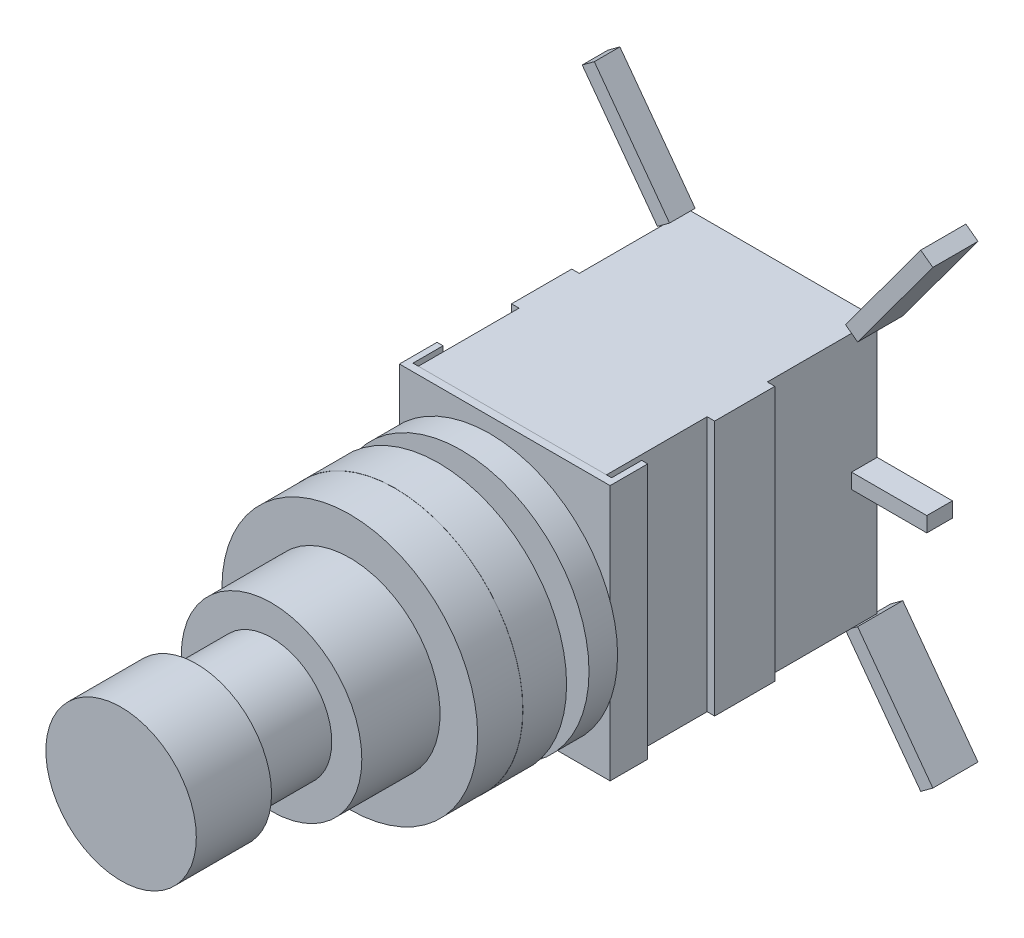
ISO-10303-21;
HEADER;
FILE_DESCRIPTION(('STEP AP214'),'2;1');
FILE_NAME('part.step','',(''),(''),'','','');
FILE_SCHEMA(('AUTOMOTIVE_DESIGN { 1 0 10303 214 1 1 1 1 }'));
ENDSEC;
DATA;
#1=APPLICATION_CONTEXT('core data for automotive mechanical design processes');
#2=APPLICATION_PROTOCOL_DEFINITION('international standard','automotive_design',2000,#1);
#3=PRODUCT_CONTEXT('',#1,'mechanical');
#4=PRODUCT('Part','Part','',(#3));
#5=PRODUCT_RELATED_PRODUCT_CATEGORY('part','',(#4));
#6=PRODUCT_DEFINITION_FORMATION('','',#4);
#7=PRODUCT_DEFINITION_CONTEXT('part definition',#1,'design');
#8=PRODUCT_DEFINITION('design','',#6,#7);
#9=PRODUCT_DEFINITION_SHAPE('','',#8);
#10=(LENGTH_UNIT() NAMED_UNIT(*) SI_UNIT(.MILLI.,.METRE.));
#11=(NAMED_UNIT(*) PLANE_ANGLE_UNIT() SI_UNIT($,.RADIAN.));
#12=(NAMED_UNIT(*) SI_UNIT($,.STERADIAN.) SOLID_ANGLE_UNIT());
#13=UNCERTAINTY_MEASURE_WITH_UNIT(LENGTH_MEASURE(1.E-05),#10,'distance_accuracy_value','');
#14=(GEOMETRIC_REPRESENTATION_CONTEXT(3) GLOBAL_UNCERTAINTY_ASSIGNED_CONTEXT((#13)) GLOBAL_UNIT_ASSIGNED_CONTEXT((#10,
#11,#12)) REPRESENTATION_CONTEXT('',''));
#15=CARTESIAN_POINT('',(0.,0.,0.));
#16=DIRECTION('',(0.,0.,1.));
#17=DIRECTION('',(1.,0.,0.));
#18=AXIS2_PLACEMENT_3D('',#15,#16,#17);
#19=CARTESIAN_POINT('',(-20.4973498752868,-28.6869935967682,-26.3899153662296));
#20=DIRECTION('',(-0.805318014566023,0.592843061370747,0.));
#21=DIRECTION('',(-0.592843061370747,-0.805318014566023,0.));
#22=AXIS2_PLACEMENT_3D('',#19,#20,#21);
#23=PLANE('',#22);
#24=DIRECTION('',(0.592843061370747,0.805318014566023,0.));
#25=VECTOR('',#24,1.);
#26=CARTESIAN_POINT('',(-5.84734099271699,-8.78642153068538,-27.1));
#27=LINE('',#26,#25);
#28=CARTESIAN_POINT('',(-10.847340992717,-15.5784215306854,-27.1));
#29=VERTEX_POINT('',#28);
#30=CARTESIAN_POINT('',(-5.84734099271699,-8.78642153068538,-27.1));
#31=VERTEX_POINT('',#30);
#32=EDGE_CURVE('E78',#29,#31,#27,.T.);
#33=ORIENTED_EDGE('',*,*,#32,.F.);
#34=DIRECTION('',(0.,0.,1.));
#35=VECTOR('',#34,1.);
#36=CARTESIAN_POINT('',(-10.847340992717,-15.5784215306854,-27.1));
#37=LINE('',#36,#35);
#38=CARTESIAN_POINT('',(-10.847340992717,-15.5784215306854,-30.1));
#39=VERTEX_POINT('',#38);
#40=EDGE_CURVE('E99',#39,#29,#37,.T.);
#41=ORIENTED_EDGE('',*,*,#40,.F.);
#42=DIRECTION('',(-0.592843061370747,-0.805318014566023,0.));
#43=VECTOR('',#42,1.);
#44=CARTESIAN_POINT('',(-5.84734099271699,-8.78642153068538,-30.1));
#45=LINE('',#44,#43);
#46=CARTESIAN_POINT('',(-5.84734099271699,-8.78642153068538,-30.1));
#47=VERTEX_POINT('',#46);
#48=EDGE_CURVE('E125',#47,#39,#45,.T.);
#49=ORIENTED_EDGE('',*,*,#48,.F.);
#50=DIRECTION('',(0.,0.,-1.));
#51=VECTOR('',#50,1.);
#52=CARTESIAN_POINT('',(-5.84734099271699,-8.78642153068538,-27.1));
#53=LINE('',#52,#51);
#54=EDGE_CURVE('E13',#31,#47,#53,.T.);
#55=ORIENTED_EDGE('',*,*,#54,.F.);
#56=EDGE_LOOP('',(#33,#41,#49,#55));
#57=FACE_BOUND('',#56,.T.);
#58=ADVANCED_FACE('F48',(#57),#23,.F.);
#59=CARTESIAN_POINT('',(-6.25,-8.49,-27.1));
#60=DIRECTION('',(0.,0.,-1.));
#61=DIRECTION('',(-1.,0.,0.));
#62=AXIS2_PLACEMENT_3D('',#59,#60,#61);
#63=PLANE('',#62);
#64=ORIENTED_EDGE('',*,*,#32,.T.);
#65=DIRECTION('',(0.805318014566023,-0.592843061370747,0.));
#66=VECTOR('',#65,1.);
#67=CARTESIAN_POINT('',(-6.25,-8.49,-27.1));
#68=LINE('',#67,#66);
#69=CARTESIAN_POINT('',(-6.65265900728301,-8.19357846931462,-27.1));
#70=VERTEX_POINT('',#69);
#71=EDGE_CURVE('E88',#70,#31,#68,.T.);
#72=ORIENTED_EDGE('',*,*,#71,.F.);
#73=DIRECTION('',(0.592843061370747,0.805318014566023,0.));
#74=VECTOR('',#73,1.);
#75=CARTESIAN_POINT('',(-6.65265900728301,-8.19357846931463,-27.1));
#76=LINE('',#75,#74);
#77=CARTESIAN_POINT('',(-11.652659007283,-14.9855784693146,-27.1));
#78=VERTEX_POINT('',#77);
#79=EDGE_CURVE('E103',#78,#70,#76,.T.);
#80=ORIENTED_EDGE('',*,*,#79,.F.);
#81=DIRECTION('',(0.805318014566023,-0.592843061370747,0.));
#82=VECTOR('',#81,1.);
#83=CARTESIAN_POINT('',(-11.25,-15.282,-27.1));
#84=LINE('',#83,#82);
#85=EDGE_CURVE('E93',#78,#29,#84,.T.);
#86=ORIENTED_EDGE('',*,*,#85,.T.);
#87=EDGE_LOOP('',(#64,#72,#80,#86));
#88=FACE_BOUND('',#87,.T.);
#89=ADVANCED_FACE('F107',(#88),#63,.F.);
#90=CARTESIAN_POINT('',(-11.25,-15.282,-27.1));
#91=DIRECTION('',(0.592843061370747,0.805318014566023,0.));
#92=DIRECTION('',(-0.805318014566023,0.592843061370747,0.));
#93=AXIS2_PLACEMENT_3D('',#90,#91,#92);
#94=PLANE('',#93);
#95=ORIENTED_EDGE('',*,*,#40,.T.);
#96=ORIENTED_EDGE('',*,*,#85,.F.);
#97=DIRECTION('',(0.,0.,1.));
#98=VECTOR('',#97,1.);
#99=CARTESIAN_POINT('',(-11.652659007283,-14.9855784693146,-27.1));
#100=LINE('',#99,#98);
#101=CARTESIAN_POINT('',(-11.652659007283,-14.9855784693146,-30.1));
#102=VERTEX_POINT('',#101);
#103=EDGE_CURVE('E97',#102,#78,#100,.T.);
#104=ORIENTED_EDGE('',*,*,#103,.F.);
#105=DIRECTION('',(0.805318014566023,-0.592843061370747,0.));
#106=VECTOR('',#105,1.);
#107=CARTESIAN_POINT('',(-11.25,-15.282,-30.1));
#108=LINE('',#107,#106);
#109=EDGE_CURVE('E134',#102,#39,#108,.T.);
#110=ORIENTED_EDGE('',*,*,#109,.T.);
#111=EDGE_LOOP('',(#95,#96,#104,#110));
#112=FACE_BOUND('',#111,.T.);
#113=ADVANCED_FACE('F95',(#112),#94,.F.);
#114=CARTESIAN_POINT('',(-6.25,-8.49,-30.1));
#115=DIRECTION('',(0.,0.,1.));
#116=DIRECTION('',(1.,0.,0.));
#117=AXIS2_PLACEMENT_3D('',#114,#115,#116);
#118=PLANE('',#117);
#119=ORIENTED_EDGE('',*,*,#48,.T.);
#120=ORIENTED_EDGE('',*,*,#109,.F.);
#121=DIRECTION('',(-0.592843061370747,-0.805318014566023,0.));
#122=VECTOR('',#121,1.);
#123=CARTESIAN_POINT('',(-6.65265900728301,-8.19357846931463,-30.1));
#124=LINE('',#123,#122);
#125=CARTESIAN_POINT('',(-6.65265900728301,-8.19357846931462,-30.1));
#126=VERTEX_POINT('',#125);
#127=EDGE_CURVE('E105',#126,#102,#124,.T.);
#128=ORIENTED_EDGE('',*,*,#127,.F.);
#129=DIRECTION('',(0.805318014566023,-0.592843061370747,0.));
#130=VECTOR('',#129,1.);
#131=CARTESIAN_POINT('',(-6.25,-8.49,-30.1));
#132=LINE('',#131,#130);
#133=EDGE_CURVE('E57',#126,#47,#132,.T.);
#134=ORIENTED_EDGE('',*,*,#133,.T.);
#135=EDGE_LOOP('',(#119,#120,#128,#134));
#136=FACE_BOUND('',#135,.T.);
#137=ADVANCED_FACE('F145',(#136),#118,.F.);
#138=CARTESIAN_POINT('',(-6.25,-8.49,-27.1));
#139=DIRECTION('',(-0.592843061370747,-0.805318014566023,0.));
#140=DIRECTION('',(0.805318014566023,-0.592843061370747,0.));
#141=AXIS2_PLACEMENT_3D('',#138,#139,#140);
#142=PLANE('',#141);
#143=ORIENTED_EDGE('',*,*,#54,.T.);
#144=ORIENTED_EDGE('',*,*,#133,.F.);
#145=DIRECTION('',(0.,0.,-1.));
#146=VECTOR('',#145,1.);
#147=CARTESIAN_POINT('',(-6.65265900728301,-8.19357846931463,-27.1));
#148=LINE('',#147,#146);
#149=EDGE_CURVE('E112',#70,#126,#148,.T.);
#150=ORIENTED_EDGE('',*,*,#149,.F.);
#151=ORIENTED_EDGE('',*,*,#71,.T.);
#152=EDGE_LOOP('',(#143,#144,#150,#151));
#153=FACE_BOUND('',#152,.T.);
#154=ADVANCED_FACE('F147',(#153),#142,.F.);
#155=CARTESIAN_POINT('',(-21.3026678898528,-28.0941505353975,-26.3899153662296));
#156=DIRECTION('',(-0.805318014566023,0.592843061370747,0.));
#157=DIRECTION('',(-0.592843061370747,-0.805318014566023,0.));
#158=AXIS2_PLACEMENT_3D('',#155,#156,#157);
#159=PLANE('',#158);
#160=ORIENTED_EDGE('',*,*,#79,.T.);
#161=ORIENTED_EDGE('',*,*,#149,.T.);
#162=ORIENTED_EDGE('',*,*,#127,.T.);
#163=ORIENTED_EDGE('',*,*,#103,.T.);
#164=EDGE_LOOP('',(#160,#161,#162,#163));
#165=FACE_BOUND('',#164,.T.);
#166=ADVANCED_FACE('F102',(#165),#159,.T.);
#167=CLOSED_SHELL('',(#58,#89,#113,#137,#154,#166));
#168=MANIFOLD_SOLID_BREP('B2',#167);
#169=CARTESIAN_POINT('',(-2.9973498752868,-4.91499359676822,-26.3899153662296));
#170=DIRECTION('',(-0.805318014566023,0.592843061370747,0.));
#171=DIRECTION('',(-0.592843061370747,-0.805318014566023,0.));
#172=AXIS2_PLACEMENT_3D('',#169,#170,#171);
#173=PLANE('',#172);
#174=DIRECTION('',(-0.592843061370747,-0.805318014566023,0.));
#175=VECTOR('',#174,1.);
#176=CARTESIAN_POINT('',(6.65265900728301,8.19357846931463,-30.1));
#177=LINE('',#176,#175);
#178=CARTESIAN_POINT('',(11.652659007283,14.9855784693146,-30.1));
#179=VERTEX_POINT('',#178);
#180=CARTESIAN_POINT('',(6.65265900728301,8.19357846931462,-30.1));
#181=VERTEX_POINT('',#180);
#182=EDGE_CURVE('E236',#179,#181,#177,.T.);
#183=ORIENTED_EDGE('',*,*,#182,.F.);
#184=DIRECTION('',(0.,0.,-1.));
#185=VECTOR('',#184,1.);
#186=CARTESIAN_POINT('',(11.652659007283,14.9855784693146,-30.1));
#187=LINE('',#186,#185);
#188=CARTESIAN_POINT('',(11.652659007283,14.9855784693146,-27.1));
#189=VERTEX_POINT('',#188);
#190=EDGE_CURVE('E257',#189,#179,#187,.T.);
#191=ORIENTED_EDGE('',*,*,#190,.F.);
#192=DIRECTION('',(0.592843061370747,0.805318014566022,0.));
#193=VECTOR('',#192,1.);
#194=CARTESIAN_POINT('',(6.65265900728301,8.19357846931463,-27.1));
#195=LINE('',#194,#193);
#196=CARTESIAN_POINT('',(6.65265900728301,8.19357846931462,-27.1));
#197=VERTEX_POINT('',#196);
#198=EDGE_CURVE('E283',#197,#189,#195,.T.);
#199=ORIENTED_EDGE('',*,*,#198,.F.);
#200=DIRECTION('',(0.,0.,1.));
#201=VECTOR('',#200,1.);
#202=CARTESIAN_POINT('',(6.65265900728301,8.19357846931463,-30.1));
#203=LINE('',#202,#201);
#204=EDGE_CURVE('E46',#181,#197,#203,.T.);
#205=ORIENTED_EDGE('',*,*,#204,.F.);
#206=EDGE_LOOP('',(#183,#191,#199,#205));
#207=FACE_BOUND('',#206,.T.);
#208=ADVANCED_FACE('F206',(#207),#173,.F.);
#209=CARTESIAN_POINT('',(6.25,8.49,-30.1));
#210=DIRECTION('',(0.,0.,1.));
#211=DIRECTION('',(1.,0.,0.));
#212=AXIS2_PLACEMENT_3D('',#209,#210,#211);
#213=PLANE('',#212);
#214=ORIENTED_EDGE('',*,*,#182,.T.);
#215=DIRECTION('',(0.805318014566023,-0.592843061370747,0.));
#216=VECTOR('',#215,1.);
#217=CARTESIAN_POINT('',(6.25,8.49,-30.1));
#218=LINE('',#217,#216);
#219=CARTESIAN_POINT('',(5.84734099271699,8.78642153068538,-30.1));
#220=VERTEX_POINT('',#219);
#221=EDGE_CURVE('E246',#220,#181,#218,.T.);
#222=ORIENTED_EDGE('',*,*,#221,.F.);
#223=DIRECTION('',(-0.592843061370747,-0.805318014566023,0.));
#224=VECTOR('',#223,1.);
#225=CARTESIAN_POINT('',(5.84734099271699,8.78642153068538,-30.1));
#226=LINE('',#225,#224);
#227=CARTESIAN_POINT('',(10.847340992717,15.5784215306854,-30.1));
#228=VERTEX_POINT('',#227);
#229=EDGE_CURVE('E261',#228,#220,#226,.T.);
#230=ORIENTED_EDGE('',*,*,#229,.F.);
#231=DIRECTION('',(0.805318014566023,-0.592843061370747,0.));
#232=VECTOR('',#231,1.);
#233=CARTESIAN_POINT('',(11.25,15.282,-30.1));
#234=LINE('',#233,#232);
#235=EDGE_CURVE('E251',#228,#179,#234,.T.);
#236=ORIENTED_EDGE('',*,*,#235,.T.);
#237=EDGE_LOOP('',(#214,#222,#230,#236));
#238=FACE_BOUND('',#237,.T.);
#239=ADVANCED_FACE('F265',(#238),#213,.F.);
#240=CARTESIAN_POINT('',(11.25,15.282,-30.1));
#241=DIRECTION('',(-0.592843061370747,-0.805318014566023,0.));
#242=DIRECTION('',(0.805318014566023,-0.592843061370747,0.));
#243=AXIS2_PLACEMENT_3D('',#240,#241,#242);
#244=PLANE('',#243);
#245=ORIENTED_EDGE('',*,*,#190,.T.);
#246=ORIENTED_EDGE('',*,*,#235,.F.);
#247=DIRECTION('',(0.,0.,-1.));
#248=VECTOR('',#247,1.);
#249=CARTESIAN_POINT('',(10.847340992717,15.5784215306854,-30.1));
#250=LINE('',#249,#248);
#251=CARTESIAN_POINT('',(10.847340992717,15.5784215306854,-27.1));
#252=VERTEX_POINT('',#251);
#253=EDGE_CURVE('E255',#252,#228,#250,.T.);
#254=ORIENTED_EDGE('',*,*,#253,.F.);
#255=DIRECTION('',(0.805318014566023,-0.592843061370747,0.));
#256=VECTOR('',#255,1.);
#257=CARTESIAN_POINT('',(11.25,15.282,-27.1));
#258=LINE('',#257,#256);
#259=EDGE_CURVE('E292',#252,#189,#258,.T.);
#260=ORIENTED_EDGE('',*,*,#259,.T.);
#261=EDGE_LOOP('',(#245,#246,#254,#260));
#262=FACE_BOUND('',#261,.T.);
#263=ADVANCED_FACE('F253',(#262),#244,.F.);
#264=CARTESIAN_POINT('',(6.25,8.49,-27.1));
#265=DIRECTION('',(0.,0.,-1.));
#266=DIRECTION('',(-1.,0.,0.));
#267=AXIS2_PLACEMENT_3D('',#264,#265,#266);
#268=PLANE('',#267);
#269=ORIENTED_EDGE('',*,*,#198,.T.);
#270=ORIENTED_EDGE('',*,*,#259,.F.);
#271=DIRECTION('',(0.592843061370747,0.805318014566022,0.));
#272=VECTOR('',#271,1.);
#273=CARTESIAN_POINT('',(5.84734099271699,8.78642153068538,-27.1));
#274=LINE('',#273,#272);
#275=CARTESIAN_POINT('',(5.84734099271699,8.78642153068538,-27.1));
#276=VERTEX_POINT('',#275);
#277=EDGE_CURVE('E263',#276,#252,#274,.T.);
#278=ORIENTED_EDGE('',*,*,#277,.F.);
#279=DIRECTION('',(0.805318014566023,-0.592843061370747,0.));
#280=VECTOR('',#279,1.);
#281=CARTESIAN_POINT('',(6.25,8.49,-27.1));
#282=LINE('',#281,#280);
#283=EDGE_CURVE('E215',#276,#197,#282,.T.);
#284=ORIENTED_EDGE('',*,*,#283,.T.);
#285=EDGE_LOOP('',(#269,#270,#278,#284));
#286=FACE_BOUND('',#285,.T.);
#287=ADVANCED_FACE('F303',(#286),#268,.F.);
#288=CARTESIAN_POINT('',(6.25,8.49,-30.1));
#289=DIRECTION('',(0.592843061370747,0.805318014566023,0.));
#290=DIRECTION('',(-0.805318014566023,0.592843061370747,0.));
#291=AXIS2_PLACEMENT_3D('',#288,#289,#290);
#292=PLANE('',#291);
#293=ORIENTED_EDGE('',*,*,#204,.T.);
#294=ORIENTED_EDGE('',*,*,#283,.F.);
#295=DIRECTION('',(0.,0.,1.));
#296=VECTOR('',#295,1.);
#297=CARTESIAN_POINT('',(5.84734099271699,8.78642153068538,-30.1));
#298=LINE('',#297,#296);
#299=EDGE_CURVE('E270',#220,#276,#298,.T.);
#300=ORIENTED_EDGE('',*,*,#299,.F.);
#301=ORIENTED_EDGE('',*,*,#221,.T.);
#302=EDGE_LOOP('',(#293,#294,#300,#301));
#303=FACE_BOUND('',#302,.T.);
#304=ADVANCED_FACE('F305',(#303),#292,.F.);
#305=CARTESIAN_POINT('',(-3.80266788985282,-4.32215053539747,-26.3899153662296));
#306=DIRECTION('',(-0.805318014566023,0.592843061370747,0.));
#307=DIRECTION('',(-0.592843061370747,-0.805318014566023,0.));
#308=AXIS2_PLACEMENT_3D('',#305,#306,#307);
#309=PLANE('',#308);
#310=ORIENTED_EDGE('',*,*,#229,.T.);
#311=ORIENTED_EDGE('',*,*,#299,.T.);
#312=ORIENTED_EDGE('',*,*,#277,.T.);
#313=ORIENTED_EDGE('',*,*,#253,.T.);
#314=EDGE_LOOP('',(#310,#311,#312,#313));
#315=FACE_BOUND('',#314,.T.);
#316=ADVANCED_FACE('F260',(#315),#309,.T.);
#317=CLOSED_SHELL('',(#208,#239,#263,#287,#304,#316));
#318=MANIFOLD_SOLID_BREP('B7',#317);
#319=CARTESIAN_POINT('',(20.4973498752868,-28.6869935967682,-26.3899153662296));
#320=DIRECTION('',(-0.805318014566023,-0.592843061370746,0.));
#321=DIRECTION('',(0.592843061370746,-0.805318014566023,0.));
#322=AXIS2_PLACEMENT_3D('',#319,#320,#321);
#323=PLANE('',#322);
#324=DIRECTION('',(0.,0.,1.));
#325=VECTOR('',#324,1.);
#326=CARTESIAN_POINT('',(5.84734099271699,-8.78642153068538,-30.1));
#327=LINE('',#326,#325);
#328=CARTESIAN_POINT('',(5.84734099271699,-8.78642153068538,-30.1));
#329=VERTEX_POINT('',#328);
#330=CARTESIAN_POINT('',(5.84734099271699,-8.78642153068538,-27.1));
#331=VERTEX_POINT('',#330);
#332=EDGE_CURVE('E204',#329,#331,#327,.T.);
#333=ORIENTED_EDGE('',*,*,#332,.F.);
#334=DIRECTION('',(-0.592843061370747,0.805318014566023,0.));
#335=VECTOR('',#334,1.);
#336=CARTESIAN_POINT('',(5.84734099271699,-8.78642153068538,-30.1));
#337=LINE('',#336,#335);
#338=CARTESIAN_POINT('',(10.847340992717,-15.5784215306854,-30.1));
#339=VERTEX_POINT('',#338);
#340=EDGE_CURVE('E394',#339,#329,#337,.T.);
#341=ORIENTED_EDGE('',*,*,#340,.F.);
#342=DIRECTION('',(0.,0.,-1.));
#343=VECTOR('',#342,1.);
#344=CARTESIAN_POINT('',(10.847340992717,-15.5784215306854,-30.1));
#345=LINE('',#344,#343);
#346=CARTESIAN_POINT('',(10.847340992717,-15.5784215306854,-27.1));
#347=VERTEX_POINT('',#346);
#348=EDGE_CURVE('E415',#347,#339,#345,.T.);
#349=ORIENTED_EDGE('',*,*,#348,.F.);
#350=DIRECTION('',(0.592843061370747,-0.805318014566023,0.));
#351=VECTOR('',#350,1.);
#352=CARTESIAN_POINT('',(5.84734099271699,-8.78642153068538,-27.1));
#353=LINE('',#352,#351);
#354=EDGE_CURVE('E441',#331,#347,#353,.T.);
#355=ORIENTED_EDGE('',*,*,#354,.F.);
#356=EDGE_LOOP('',(#333,#341,#349,#355));
#357=FACE_BOUND('',#356,.T.);
#358=ADVANCED_FACE('F364',(#357),#323,.T.);
#359=CARTESIAN_POINT('',(6.25,-8.49,-30.1));
#360=DIRECTION('',(0.,0.,1.));
#361=DIRECTION('',(1.,0.,0.));
#362=AXIS2_PLACEMENT_3D('',#359,#360,#361);
#363=PLANE('',#362);
#364=ORIENTED_EDGE('',*,*,#340,.T.);
#365=DIRECTION('',(-0.805318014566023,-0.592843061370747,0.));
#366=VECTOR('',#365,1.);
#367=CARTESIAN_POINT('',(6.25,-8.49,-30.1));
#368=LINE('',#367,#366);
#369=CARTESIAN_POINT('',(6.65265900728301,-8.19357846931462,-30.1));
#370=VERTEX_POINT('',#369);
#371=EDGE_CURVE('E404',#370,#329,#368,.T.);
#372=ORIENTED_EDGE('',*,*,#371,.F.);
#373=DIRECTION('',(-0.592843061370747,0.805318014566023,0.));
#374=VECTOR('',#373,1.);
#375=CARTESIAN_POINT('',(6.65265900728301,-8.19357846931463,-30.1));
#376=LINE('',#375,#374);
#377=CARTESIAN_POINT('',(11.652659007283,-14.9855784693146,-30.1));
#378=VERTEX_POINT('',#377);
#379=EDGE_CURVE('E419',#378,#370,#376,.T.);
#380=ORIENTED_EDGE('',*,*,#379,.F.);
#381=DIRECTION('',(-0.805318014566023,-0.592843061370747,0.));
#382=VECTOR('',#381,1.);
#383=CARTESIAN_POINT('',(11.25,-15.282,-30.1));
#384=LINE('',#383,#382);
#385=EDGE_CURVE('E409',#378,#339,#384,.T.);
#386=ORIENTED_EDGE('',*,*,#385,.T.);
#387=EDGE_LOOP('',(#364,#372,#380,#386));
#388=FACE_BOUND('',#387,.T.);
#389=ADVANCED_FACE('F423',(#388),#363,.F.);
#390=CARTESIAN_POINT('',(11.25,-15.282,-30.1));
#391=DIRECTION('',(-0.592843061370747,0.805318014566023,0.));
#392=DIRECTION('',(-0.805318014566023,-0.592843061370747,0.));
#393=AXIS2_PLACEMENT_3D('',#390,#391,#392);
#394=PLANE('',#393);
#395=ORIENTED_EDGE('',*,*,#348,.T.);
#396=ORIENTED_EDGE('',*,*,#385,.F.);
#397=DIRECTION('',(0.,0.,-1.));
#398=VECTOR('',#397,1.);
#399=CARTESIAN_POINT('',(11.652659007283,-14.9855784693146,-30.1));
#400=LINE('',#399,#398);
#401=CARTESIAN_POINT('',(11.652659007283,-14.9855784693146,-27.1));
#402=VERTEX_POINT('',#401);
#403=EDGE_CURVE('E413',#402,#378,#400,.T.);
#404=ORIENTED_EDGE('',*,*,#403,.F.);
#405=DIRECTION('',(-0.805318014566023,-0.592843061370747,0.));
#406=VECTOR('',#405,1.);
#407=CARTESIAN_POINT('',(11.25,-15.282,-27.1));
#408=LINE('',#407,#406);
#409=EDGE_CURVE('E450',#402,#347,#408,.T.);
#410=ORIENTED_EDGE('',*,*,#409,.T.);
#411=EDGE_LOOP('',(#395,#396,#404,#410));
#412=FACE_BOUND('',#411,.T.);
#413=ADVANCED_FACE('F411',(#412),#394,.F.);
#414=CARTESIAN_POINT('',(6.25,-8.49,-27.1));
#415=DIRECTION('',(0.,0.,-1.));
#416=DIRECTION('',(0.,1.,0.));
#417=AXIS2_PLACEMENT_3D('',#414,#415,#416);
#418=PLANE('',#417);
#419=ORIENTED_EDGE('',*,*,#354,.T.);
#420=ORIENTED_EDGE('',*,*,#409,.F.);
#421=DIRECTION('',(0.592843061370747,-0.805318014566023,0.));
#422=VECTOR('',#421,1.);
#423=CARTESIAN_POINT('',(6.65265900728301,-8.19357846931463,-27.1));
#424=LINE('',#423,#422);
#425=CARTESIAN_POINT('',(6.65265900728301,-8.19357846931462,-27.1));
#426=VERTEX_POINT('',#425);
#427=EDGE_CURVE('E421',#426,#402,#424,.T.);
#428=ORIENTED_EDGE('',*,*,#427,.F.);
#429=DIRECTION('',(-0.805318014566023,-0.592843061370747,0.));
#430=VECTOR('',#429,1.);
#431=CARTESIAN_POINT('',(6.25,-8.49,-27.1));
#432=LINE('',#431,#430);
#433=EDGE_CURVE('E373',#426,#331,#432,.T.);
#434=ORIENTED_EDGE('',*,*,#433,.T.);
#435=EDGE_LOOP('',(#419,#420,#428,#434));
#436=FACE_BOUND('',#435,.T.);
#437=ADVANCED_FACE('F461',(#436),#418,.F.);
#438=CARTESIAN_POINT('',(6.25,-8.49,-30.1));
#439=DIRECTION('',(0.592843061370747,-0.805318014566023,0.));
#440=DIRECTION('',(0.805318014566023,0.592843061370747,0.));
#441=AXIS2_PLACEMENT_3D('',#438,#439,#440);
#442=PLANE('',#441);
#443=ORIENTED_EDGE('',*,*,#332,.T.);
#444=ORIENTED_EDGE('',*,*,#433,.F.);
#445=DIRECTION('',(0.,0.,1.));
#446=VECTOR('',#445,1.);
#447=CARTESIAN_POINT('',(6.65265900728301,-8.19357846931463,-30.1));
#448=LINE('',#447,#446);
#449=EDGE_CURVE('E428',#370,#426,#448,.T.);
#450=ORIENTED_EDGE('',*,*,#449,.F.);
#451=ORIENTED_EDGE('',*,*,#371,.T.);
#452=EDGE_LOOP('',(#443,#444,#450,#451));
#453=FACE_BOUND('',#452,.T.);
#454=ADVANCED_FACE('F463',(#453),#442,.F.);
#455=CARTESIAN_POINT('',(21.3026678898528,-28.0941505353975,-26.3899153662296));
#456=DIRECTION('',(-0.805318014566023,-0.592843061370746,0.));
#457=DIRECTION('',(0.592843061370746,-0.805318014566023,0.));
#458=AXIS2_PLACEMENT_3D('',#455,#456,#457);
#459=PLANE('',#458);
#460=ORIENTED_EDGE('',*,*,#449,.T.);
#461=ORIENTED_EDGE('',*,*,#427,.T.);
#462=ORIENTED_EDGE('',*,*,#403,.T.);
#463=ORIENTED_EDGE('',*,*,#379,.T.);
#464=EDGE_LOOP('',(#460,#461,#462,#463));
#465=FACE_BOUND('',#464,.T.);
#466=ADVANCED_FACE('F418',(#465),#459,.F.);
#467=CLOSED_SHELL('',(#358,#389,#413,#437,#454,#466));
#468=MANIFOLD_SOLID_BREP('B40',#467);
#469=CARTESIAN_POINT('',(2.85228899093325,-4.7179428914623,-25.7663019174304));
#470=DIRECTION('',(-0.805318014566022,-0.592843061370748,0.));
#471=DIRECTION('',(0.592843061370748,-0.805318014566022,0.));
#472=AXIS2_PLACEMENT_3D('',#469,#470,#471);
#473=PLANE('',#472);
#474=DIRECTION('',(0.592843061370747,-0.805318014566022,0.));
#475=VECTOR('',#474,1.);
#476=CARTESIAN_POINT('',(-6.65265900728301,8.19357846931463,-28.8));
#477=LINE('',#476,#475);
#478=CARTESIAN_POINT('',(-11.652659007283,14.9855784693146,-28.8));
#479=VERTEX_POINT('',#478);
#480=CARTESIAN_POINT('',(-6.65265900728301,8.19357846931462,-28.8));
#481=VERTEX_POINT('',#480);
#482=EDGE_CURVE('E547',#479,#481,#477,.T.);
#483=ORIENTED_EDGE('',*,*,#482,.T.);
#484=DIRECTION('',(0.,0.,1.));
#485=VECTOR('',#484,1.);
#486=CARTESIAN_POINT('',(-6.65265900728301,8.19357846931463,-28.8));
#487=LINE('',#486,#485);
#488=CARTESIAN_POINT('',(-6.65265900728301,8.19357846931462,-27.1));
#489=VERTEX_POINT('',#488);
#490=EDGE_CURVE('E362',#481,#489,#487,.T.);
#491=ORIENTED_EDGE('',*,*,#490,.T.);
#492=DIRECTION('',(-0.592843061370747,0.805318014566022,0.));
#493=VECTOR('',#492,1.);
#494=CARTESIAN_POINT('',(-6.65265900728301,8.19357846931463,-27.1));
#495=LINE('',#494,#493);
#496=CARTESIAN_POINT('',(-11.652659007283,14.9855784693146,-27.1));
#497=VERTEX_POINT('',#496);
#498=EDGE_CURVE('E602',#489,#497,#495,.T.);
#499=ORIENTED_EDGE('',*,*,#498,.T.);
#500=DIRECTION('',(0.,0.,-1.));
#501=VECTOR('',#500,1.);
#502=CARTESIAN_POINT('',(-11.652659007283,14.9855784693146,-28.8));
#503=LINE('',#502,#501);
#504=EDGE_CURVE('E598',#497,#479,#503,.T.);
#505=ORIENTED_EDGE('',*,*,#504,.T.);
#506=EDGE_LOOP('',(#483,#491,#499,#505));
#507=FACE_BOUND('',#506,.T.);
#508=ADVANCED_FACE('F521',(#507),#473,.T.);
#509=CARTESIAN_POINT('',(-6.25,8.49,-28.8));
#510=DIRECTION('',(0.,0.,-1.));
#511=DIRECTION('',(-1.,0.,0.));
#512=AXIS2_PLACEMENT_3D('',#509,#510,#511);
#513=PLANE('',#512);
#514=ORIENTED_EDGE('',*,*,#482,.F.);
#515=DIRECTION('',(-0.805318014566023,-0.592843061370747,0.));
#516=VECTOR('',#515,1.);
#517=CARTESIAN_POINT('',(-11.25,15.282,-28.8));
#518=LINE('',#517,#516);
#519=CARTESIAN_POINT('',(-10.847340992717,15.5784215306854,-28.8));
#520=VERTEX_POINT('',#519);
#521=EDGE_CURVE('E566',#520,#479,#518,.T.);
#522=ORIENTED_EDGE('',*,*,#521,.F.);
#523=DIRECTION('',(0.592843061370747,-0.805318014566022,0.));
#524=VECTOR('',#523,1.);
#525=CARTESIAN_POINT('',(-5.84734099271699,8.78642153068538,-28.8));
#526=LINE('',#525,#524);
#527=CARTESIAN_POINT('',(-5.84734099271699,8.78642153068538,-28.8));
#528=VERTEX_POINT('',#527);
#529=EDGE_CURVE('E570',#520,#528,#526,.T.);
#530=ORIENTED_EDGE('',*,*,#529,.T.);
#531=DIRECTION('',(-0.805318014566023,-0.592843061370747,0.));
#532=VECTOR('',#531,1.);
#533=CARTESIAN_POINT('',(-6.25,8.49,-28.8));
#534=LINE('',#533,#532);
#535=EDGE_CURVE('E561',#528,#481,#534,.T.);
#536=ORIENTED_EDGE('',*,*,#535,.T.);
#537=EDGE_LOOP('',(#514,#522,#530,#536));
#538=FACE_BOUND('',#537,.T.);
#539=ADVANCED_FACE('F568',(#538),#513,.T.);
#540=CARTESIAN_POINT('',(-11.25,15.282,-28.8));
#541=DIRECTION('',(-0.592843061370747,0.805318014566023,0.));
#542=DIRECTION('',(-0.805318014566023,-0.592843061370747,0.));
#543=AXIS2_PLACEMENT_3D('',#540,#541,#542);
#544=PLANE('',#543);
#545=ORIENTED_EDGE('',*,*,#504,.F.);
#546=DIRECTION('',(-0.805318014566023,-0.592843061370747,0.));
#547=VECTOR('',#546,1.);
#548=CARTESIAN_POINT('',(-11.25,15.282,-27.1));
#549=LINE('',#548,#547);
#550=CARTESIAN_POINT('',(-10.847340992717,15.5784215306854,-27.1));
#551=VERTEX_POINT('',#550);
#552=EDGE_CURVE('E578',#551,#497,#549,.T.);
#553=ORIENTED_EDGE('',*,*,#552,.F.);
#554=DIRECTION('',(0.,0.,-1.));
#555=VECTOR('',#554,1.);
#556=CARTESIAN_POINT('',(-10.847340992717,15.5784215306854,-28.8));
#557=LINE('',#556,#555);
#558=EDGE_CURVE('E575',#551,#520,#557,.T.);
#559=ORIENTED_EDGE('',*,*,#558,.T.);
#560=ORIENTED_EDGE('',*,*,#521,.T.);
#561=EDGE_LOOP('',(#545,#553,#559,#560));
#562=FACE_BOUND('',#561,.T.);
#563=ADVANCED_FACE('F576',(#562),#544,.T.);
#564=CARTESIAN_POINT('',(-6.25,8.49,-27.1));
#565=DIRECTION('',(0.,0.,1.));
#566=DIRECTION('',(1.,0.,0.));
#567=AXIS2_PLACEMENT_3D('',#564,#565,#566);
#568=PLANE('',#567);
#569=ORIENTED_EDGE('',*,*,#498,.F.);
#570=DIRECTION('',(-0.805318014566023,-0.592843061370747,0.));
#571=VECTOR('',#570,1.);
#572=CARTESIAN_POINT('',(-6.25,8.49,-27.1));
#573=LINE('',#572,#571);
#574=CARTESIAN_POINT('',(-5.84734099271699,8.78642153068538,-27.1));
#575=VERTEX_POINT('',#574);
#576=EDGE_CURVE('E530',#575,#489,#573,.T.);
#577=ORIENTED_EDGE('',*,*,#576,.F.);
#578=DIRECTION('',(-0.592843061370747,0.805318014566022,0.));
#579=VECTOR('',#578,1.);
#580=CARTESIAN_POINT('',(-5.84734099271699,8.78642153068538,-27.1));
#581=LINE('',#580,#579);
#582=EDGE_CURVE('E581',#575,#551,#581,.T.);
#583=ORIENTED_EDGE('',*,*,#582,.T.);
#584=ORIENTED_EDGE('',*,*,#552,.T.);
#585=EDGE_LOOP('',(#569,#577,#583,#584));
#586=FACE_BOUND('',#585,.T.);
#587=ADVANCED_FACE('F618',(#586),#568,.T.);
#588=CARTESIAN_POINT('',(-6.25,8.49,-28.8));
#589=DIRECTION('',(0.592843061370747,-0.805318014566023,0.));
#590=DIRECTION('',(0.805318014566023,0.592843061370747,0.));
#591=AXIS2_PLACEMENT_3D('',#588,#589,#590);
#592=PLANE('',#591);
#593=ORIENTED_EDGE('',*,*,#490,.F.);
#594=ORIENTED_EDGE('',*,*,#535,.F.);
#595=DIRECTION('',(0.,0.,1.));
#596=VECTOR('',#595,1.);
#597=CARTESIAN_POINT('',(-5.84734099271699,8.78642153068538,-28.8));
#598=LINE('',#597,#596);
#599=EDGE_CURVE('E584',#528,#575,#598,.T.);
#600=ORIENTED_EDGE('',*,*,#599,.T.);
#601=ORIENTED_EDGE('',*,*,#576,.T.);
#602=EDGE_LOOP('',(#593,#594,#600,#601));
#603=FACE_BOUND('',#602,.T.);
#604=ADVANCED_FACE('F620',(#603),#592,.T.);
#605=CARTESIAN_POINT('',(3.65760700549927,-4.12509983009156,-25.7663019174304));
#606=DIRECTION('',(-0.805318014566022,-0.592843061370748,0.));
#607=DIRECTION('',(0.592843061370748,-0.805318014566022,0.));
#608=AXIS2_PLACEMENT_3D('',#605,#606,#607);
#609=PLANE('',#608);
#610=ORIENTED_EDGE('',*,*,#529,.F.);
#611=ORIENTED_EDGE('',*,*,#558,.F.);
#612=ORIENTED_EDGE('',*,*,#582,.F.);
#613=ORIENTED_EDGE('',*,*,#599,.F.);
#614=EDGE_LOOP('',(#610,#611,#612,#613));
#615=FACE_BOUND('',#614,.T.);
#616=ADVANCED_FACE('F583',(#615),#609,.F.);
#617=CLOSED_SHELL('',(#508,#539,#563,#587,#604,#616));
#618=MANIFOLD_SOLID_BREP('B198',#617);
#619=CARTESIAN_POINT('',(6.25,8.49,-28.8));
#620=DIRECTION('',(-1.,0.,0.));
#621=DIRECTION('',(0.,-1.,0.));
#622=AXIS2_PLACEMENT_3D('',#619,#620,#621);
#623=PLANE('',#622);
#624=DIRECTION('',(0.,0.,1.));
#625=VECTOR('',#624,1.);
#626=CARTESIAN_POINT('',(6.25,0.499999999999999,-28.8));
#627=LINE('',#626,#625);
#628=CARTESIAN_POINT('',(6.25,0.499999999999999,-28.8));
#629=VERTEX_POINT('',#628);
#630=CARTESIAN_POINT('',(6.25,0.499999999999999,-27.1));
#631=VERTEX_POINT('',#630);
#632=EDGE_CURVE('E1201',#629,#631,#627,.T.);
#633=ORIENTED_EDGE('',*,*,#632,.F.);
#634=DIRECTION('',(0.,-1.,0.));
#635=VECTOR('',#634,1.);
#636=CARTESIAN_POINT('',(6.25,8.49,-28.8));
#637=LINE('',#636,#635);
#638=CARTESIAN_POINT('',(6.25,8.49,-28.8));
#639=VERTEX_POINT('',#638);
#640=EDGE_CURVE('E884',#639,#629,#637,.T.);
#641=ORIENTED_EDGE('',*,*,#640,.F.);
#642=DIRECTION('',(0.,0.,1.));
#643=VECTOR('',#642,1.);
#644=CARTESIAN_POINT('',(6.25,8.49,-28.8));
#645=LINE('',#644,#643);
#646=CARTESIAN_POINT('',(6.25,8.49,-21.5));
#647=VERTEX_POINT('',#646);
#648=EDGE_CURVE('E987',#639,#647,#645,.T.);
#649=ORIENTED_EDGE('',*,*,#648,.T.);
#650=DIRECTION('',(0.,1.,0.));
#651=VECTOR('',#650,1.);
#652=CARTESIAN_POINT('',(6.25,-8.49,-21.5));
#653=LINE('',#652,#651);
#654=CARTESIAN_POINT('',(6.25,-8.49,-21.5));
#655=VERTEX_POINT('',#654);
#656=EDGE_CURVE('E942',#655,#647,#653,.T.);
#657=ORIENTED_EDGE('',*,*,#656,.F.);
#658=DIRECTION('',(0.,0.,1.));
#659=VECTOR('',#658,1.);
#660=CARTESIAN_POINT('',(6.25,-8.49,-28.8));
#661=LINE('',#660,#659);
#662=CARTESIAN_POINT('',(6.25,-8.49,-28.8));
#663=VERTEX_POINT('',#662);
#664=EDGE_CURVE('E998',#663,#655,#661,.T.);
#665=ORIENTED_EDGE('',*,*,#664,.F.);
#666=CARTESIAN_POINT('',(6.25,-0.500000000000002,-28.8));
#667=VERTEX_POINT('',#666);
#668=EDGE_CURVE('E967',#667,#663,#637,.T.);
#669=ORIENTED_EDGE('',*,*,#668,.F.);
#670=DIRECTION('',(0.,0.,-1.));
#671=VECTOR('',#670,1.);
#672=CARTESIAN_POINT('',(6.25,-0.500000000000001,-28.8));
#673=LINE('',#672,#671);
#674=CARTESIAN_POINT('',(6.25,-0.500000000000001,-27.1));
#675=VERTEX_POINT('',#674);
#676=EDGE_CURVE('E879',#675,#667,#673,.T.);
#677=ORIENTED_EDGE('',*,*,#676,.F.);
#678=DIRECTION('',(0.,-1.,0.));
#679=VECTOR('',#678,1.);
#680=CARTESIAN_POINT('',(6.25,-0.500000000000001,-27.1));
#681=LINE('',#680,#679);
#682=EDGE_CURVE('E1203',#631,#675,#681,.T.);
#683=ORIENTED_EDGE('',*,*,#682,.F.);
#684=EDGE_LOOP('',(#633,#641,#649,#657,#665,#669,#677,#683));
#685=FACE_BOUND('',#684,.T.);
#686=ADVANCED_FACE('F669',(#685),#623,.F.);
#687=CARTESIAN_POINT('',(-6.25,8.49,-28.8));
#688=DIRECTION('',(1.,0.,0.));
#689=DIRECTION('',(0.,0.,-1.));
#690=AXIS2_PLACEMENT_3D('',#687,#688,#689);
#691=PLANE('',#690);
#692=DIRECTION('',(0.,0.,-1.));
#693=VECTOR('',#692,1.);
#694=CARTESIAN_POINT('',(-6.25,0.500000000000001,-27.1));
#695=LINE('',#694,#693);
#696=CARTESIAN_POINT('',(-6.25,0.500000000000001,-27.1));
#697=VERTEX_POINT('',#696);
#698=CARTESIAN_POINT('',(-6.25,0.5,-28.8));
#699=VERTEX_POINT('',#698);
#700=EDGE_CURVE('E888',#697,#699,#695,.T.);
#701=ORIENTED_EDGE('',*,*,#700,.F.);
#702=DIRECTION('',(0.,1.,0.));
#703=VECTOR('',#702,1.);
#704=CARTESIAN_POINT('',(-6.25,-0.5,-27.1));
#705=LINE('',#704,#703);
#706=CARTESIAN_POINT('',(-6.25,-0.5,-27.1));
#707=VERTEX_POINT('',#706);
#708=EDGE_CURVE('E885',#707,#697,#705,.T.);
#709=ORIENTED_EDGE('',*,*,#708,.F.);
#710=DIRECTION('',(0.,0.,1.));
#711=VECTOR('',#710,1.);
#712=CARTESIAN_POINT('',(-6.25,-0.5,-27.1));
#713=LINE('',#712,#711);
#714=CARTESIAN_POINT('',(-6.25,-0.5,-28.8));
#715=VERTEX_POINT('',#714);
#716=EDGE_CURVE('E898',#715,#707,#713,.T.);
#717=ORIENTED_EDGE('',*,*,#716,.F.);
#718=DIRECTION('',(0.,1.,0.));
#719=VECTOR('',#718,1.);
#720=CARTESIAN_POINT('',(-6.25,8.49,-28.8));
#721=LINE('',#720,#719);
#722=CARTESIAN_POINT('',(-6.25,-8.49,-28.8));
#723=VERTEX_POINT('',#722);
#724=EDGE_CURVE('E970',#723,#715,#721,.T.);
#725=ORIENTED_EDGE('',*,*,#724,.F.);
#726=DIRECTION('',(0.,0.,1.));
#727=VECTOR('',#726,1.);
#728=CARTESIAN_POINT('',(-6.25,-8.49,-28.8));
#729=LINE('',#728,#727);
#730=CARTESIAN_POINT('',(-6.25,-8.49,-21.5));
#731=VERTEX_POINT('',#730);
#732=EDGE_CURVE('E994',#723,#731,#729,.T.);
#733=ORIENTED_EDGE('',*,*,#732,.T.);
#734=DIRECTION('',(0.,-1.,0.));
#735=VECTOR('',#734,1.);
#736=CARTESIAN_POINT('',(-6.25,8.49,-21.5));
#737=LINE('',#736,#735);
#738=CARTESIAN_POINT('',(-6.25,8.49,-21.5));
#739=VERTEX_POINT('',#738);
#740=EDGE_CURVE('E919',#739,#731,#737,.T.);
#741=ORIENTED_EDGE('',*,*,#740,.F.);
#742=DIRECTION('',(0.,0.,1.));
#743=VECTOR('',#742,1.);
#744=CARTESIAN_POINT('',(-6.25,8.49,-28.8));
#745=LINE('',#744,#743);
#746=CARTESIAN_POINT('',(-6.25,8.49,-28.8));
#747=VERTEX_POINT('',#746);
#748=EDGE_CURVE('E990',#747,#739,#745,.T.);
#749=ORIENTED_EDGE('',*,*,#748,.F.);
#750=EDGE_CURVE('E969',#699,#747,#721,.T.);
#751=ORIENTED_EDGE('',*,*,#750,.F.);
#752=EDGE_LOOP('',(#701,#709,#717,#725,#733,#741,#749,#751));
#753=FACE_BOUND('',#752,.T.);
#754=ADVANCED_FACE('F1147',(#753),#691,.F.);
#755=DIRECTION('',(0.,1.,0.));
#756=VECTOR('',#755,1.);
#757=CARTESIAN_POINT('',(-6.25,8.49,-17.5));
#758=LINE('',#757,#756);
#759=CARTESIAN_POINT('',(-6.25,-8.49,-17.5));
#760=VERTEX_POINT('',#759);
#761=CARTESIAN_POINT('',(-6.25,8.49,-17.5));
#762=VERTEX_POINT('',#761);
#763=EDGE_CURVE('E914',#760,#762,#758,.T.);
#764=ORIENTED_EDGE('',*,*,#763,.F.);
#765=CARTESIAN_POINT('',(-6.25,-8.49,-10.8));
#766=VERTEX_POINT('',#765);
#767=EDGE_CURVE('E993',#760,#766,#729,.T.);
#768=ORIENTED_EDGE('',*,*,#767,.T.);
#769=DIRECTION('',(0.,1.,0.));
#770=VECTOR('',#769,1.);
#771=CARTESIAN_POINT('',(-6.25,8.49,-10.8));
#772=LINE('',#771,#770);
#773=CARTESIAN_POINT('',(-6.25,8.49,-10.8));
#774=VERTEX_POINT('',#773);
#775=EDGE_CURVE('E981',#766,#774,#772,.T.);
#776=ORIENTED_EDGE('',*,*,#775,.T.);
#777=EDGE_CURVE('E989',#762,#774,#745,.T.);
#778=ORIENTED_EDGE('',*,*,#777,.F.);
#779=EDGE_LOOP('',(#764,#768,#776,#778));
#780=FACE_BOUND('',#779,.T.);
#781=ADVANCED_FACE('F1154',(#780),#691,.F.);
#782=DIRECTION('',(0.,-1.,0.));
#783=VECTOR('',#782,1.);
#784=CARTESIAN_POINT('',(6.25,-8.49,-17.5));
#785=LINE('',#784,#783);
#786=CARTESIAN_POINT('',(6.25,8.49,-17.5));
#787=VERTEX_POINT('',#786);
#788=CARTESIAN_POINT('',(6.25,-8.49,-17.5));
#789=VERTEX_POINT('',#788);
#790=EDGE_CURVE('E937',#787,#789,#785,.T.);
#791=ORIENTED_EDGE('',*,*,#790,.F.);
#792=CARTESIAN_POINT('',(6.25,8.49,-10.8));
#793=VERTEX_POINT('',#792);
#794=EDGE_CURVE('E975',#787,#793,#645,.T.);
#795=ORIENTED_EDGE('',*,*,#794,.T.);
#796=DIRECTION('',(0.,-1.,0.));
#797=VECTOR('',#796,1.);
#798=CARTESIAN_POINT('',(6.25,8.49,-10.8));
#799=LINE('',#798,#797);
#800=CARTESIAN_POINT('',(6.25,-8.49,-10.8));
#801=VERTEX_POINT('',#800);
#802=EDGE_CURVE('E964',#793,#801,#799,.T.);
#803=ORIENTED_EDGE('',*,*,#802,.T.);
#804=EDGE_CURVE('E997',#789,#801,#661,.T.);
#805=ORIENTED_EDGE('',*,*,#804,.F.);
#806=EDGE_LOOP('',(#791,#795,#803,#805));
#807=FACE_BOUND('',#806,.T.);
#808=ADVANCED_FACE('F1150',(#807),#623,.F.);
#809=CARTESIAN_POINT('',(-7.,-8.5,-10.8));
#810=DIRECTION('',(0.,0.,1.));
#811=DIRECTION('',(1.,0.,0.));
#812=AXIS2_PLACEMENT_3D('',#809,#810,#811);
#813=PLANE('',#812);
#814=DIRECTION('',(0.,-1.,0.));
#815=VECTOR('',#814,1.);
#816=CARTESIAN_POINT('',(-6.6,8.5,-10.8));
#817=LINE('',#816,#815);
#818=CARTESIAN_POINT('',(-6.6,8.5,-10.8));
#819=VERTEX_POINT('',#818);
#820=CARTESIAN_POINT('',(-6.6,-8.5,-10.8));
#821=VERTEX_POINT('',#820);
#822=EDGE_CURVE('E1001',#819,#821,#817,.T.);
#823=ORIENTED_EDGE('',*,*,#822,.F.);
#824=DIRECTION('',(1.,0.,0.));
#825=VECTOR('',#824,1.);
#826=CARTESIAN_POINT('',(-7.,8.5,-10.8));
#827=LINE('',#826,#825);
#828=CARTESIAN_POINT('',(6.6,8.5,-10.8));
#829=VERTEX_POINT('',#828);
#830=EDGE_CURVE('E673',#819,#829,#827,.T.);
#831=ORIENTED_EDGE('',*,*,#830,.T.);
#832=DIRECTION('',(0.,1.,0.));
#833=VECTOR('',#832,1.);
#834=CARTESIAN_POINT('',(6.6,8.5,-10.8));
#835=LINE('',#834,#833);
#836=CARTESIAN_POINT('',(6.6,-8.5,-10.8));
#837=VERTEX_POINT('',#836);
#838=EDGE_CURVE('E1020',#837,#829,#835,.T.);
#839=ORIENTED_EDGE('',*,*,#838,.F.);
#840=DIRECTION('',(-1.,0.,0.));
#841=VECTOR('',#840,1.);
#842=CARTESIAN_POINT('',(-7.,-8.5,-10.8));
#843=LINE('',#842,#841);
#844=EDGE_CURVE('E1039',#837,#821,#843,.T.);
#845=ORIENTED_EDGE('',*,*,#844,.T.);
#846=EDGE_LOOP('',(#823,#831,#839,#845));
#847=FACE_BOUND('',#846,.T.);
#848=ORIENTED_EDGE('',*,*,#802,.F.);
#849=DIRECTION('',(1.,0.,0.));
#850=VECTOR('',#849,1.);
#851=CARTESIAN_POINT('',(6.25,8.49,-10.8));
#852=LINE('',#851,#850);
#853=EDGE_CURVE('E984',#774,#793,#852,.T.);
#854=ORIENTED_EDGE('',*,*,#853,.F.);
#855=ORIENTED_EDGE('',*,*,#775,.F.);
#856=DIRECTION('',(-1.,0.,0.));
#857=VECTOR('',#856,1.);
#858=CARTESIAN_POINT('',(6.25,-8.49,-10.8));
#859=LINE('',#858,#857);
#860=EDGE_CURVE('E978',#801,#766,#859,.T.);
#861=ORIENTED_EDGE('',*,*,#860,.F.);
#862=EDGE_LOOP('',(#848,#854,#855,#861));
#863=FACE_BOUND('',#862,.T.);
#864=ADVANCED_FACE('F1160',(#847,#863),#813,.F.);
#865=CARTESIAN_POINT('',(0.,0.,-9.3));
#866=DIRECTION('',(0.,0.,-1.));
#867=DIRECTION('',(-1.,0.,0.));
#868=AXIS2_PLACEMENT_3D('',#865,#866,#867);
#869=PLANE('',#868);
#870=CARTESIAN_POINT('',(0.,0.,-9.3));
#871=DIRECTION('',(0.,0.,-1.));
#872=DIRECTION('',(-1.,0.,0.));
#873=AXIS2_PLACEMENT_3D('',#870,#871,#872);
#874=CIRCLE('',#873,8.5);
#875=CARTESIAN_POINT('',(8.5,0.,-9.3));
#876=VERTEX_POINT('',#875);
#877=EDGE_CURVE('E1093',#876,#876,#874,.T.);
#878=ORIENTED_EDGE('',*,*,#877,.T.);
#879=EDGE_LOOP('',(#878));
#880=FACE_BOUND('',#879,.T.);
#881=CARTESIAN_POINT('',(0.,0.,-9.3));
#882=DIRECTION('',(0.,0.,-1.));
#883=DIRECTION('',(-1.,0.,0.));
#884=AXIS2_PLACEMENT_3D('',#881,#882,#883);
#885=CIRCLE('',#884,6.);
#886=CARTESIAN_POINT('',(-6.,0.,-9.3));
#887=VERTEX_POINT('',#886);
#888=EDGE_CURVE('E1083',#887,#887,#885,.T.);
#889=ORIENTED_EDGE('',*,*,#888,.F.);
#890=EDGE_LOOP('',(#889));
#891=FACE_BOUND('',#890,.T.);
#892=ADVANCED_FACE('F1142',(#880,#891),#869,.T.);
#893=CARTESIAN_POINT('',(0.,0.,-5.9));
#894=DIRECTION('',(0.,0.,-1.));
#895=DIRECTION('',(-1.,0.,0.));
#896=AXIS2_PLACEMENT_3D('',#893,#894,#895);
#897=PLANE('',#896);
#898=CARTESIAN_POINT('',(0.,0.,-5.9));
#899=DIRECTION('',(0.,0.,-1.));
#900=DIRECTION('',(-1.,0.,0.));
#901=AXIS2_PLACEMENT_3D('',#898,#899,#900);
#902=CIRCLE('',#901,8.51);
#903=CARTESIAN_POINT('',(-8.51,0.,-5.9));
#904=VERTEX_POINT('',#903);
#905=EDGE_CURVE('E1105',#904,#904,#902,.T.);
#906=ORIENTED_EDGE('',*,*,#905,.T.);
#907=EDGE_LOOP('',(#906));
#908=FACE_BOUND('',#907,.T.);
#909=CARTESIAN_POINT('',(0.,0.,-5.9));
#910=DIRECTION('',(0.,0.,-1.));
#911=DIRECTION('',(-1.,0.,0.));
#912=AXIS2_PLACEMENT_3D('',#909,#910,#911);
#913=CIRCLE('',#912,6.);
#914=CARTESIAN_POINT('',(-6.,0.,-5.9));
#915=VERTEX_POINT('',#914);
#916=EDGE_CURVE('E1096',#915,#915,#913,.T.);
#917=ORIENTED_EDGE('',*,*,#916,.F.);
#918=EDGE_LOOP('',(#917));
#919=FACE_BOUND('',#918,.T.);
#920=ADVANCED_FACE('F1135',(#908,#919),#897,.T.);
#921=CARTESIAN_POINT('',(0.,0.,5.2));
#922=DIRECTION('',(0.,0.,1.));
#923=DIRECTION('',(1.,0.,0.));
#924=AXIS2_PLACEMENT_3D('',#921,#922,#923);
#925=PLANE('',#924);
#926=CARTESIAN_POINT('',(0.,0.,5.2));
#927=DIRECTION('',(0.,0.,1.));
#928=DIRECTION('',(1.,0.,0.));
#929=AXIS2_PLACEMENT_3D('',#926,#927,#928);
#930=CIRCLE('',#929,6.);
#931=CARTESIAN_POINT('',(6.,0.,5.2));
#932=VERTEX_POINT('',#931);
#933=EDGE_CURVE('E519',#932,#932,#930,.T.);
#934=ORIENTED_EDGE('',*,*,#933,.T.);
#935=EDGE_LOOP('',(#934));
#936=FACE_BOUND('',#935,.T.);
#937=CARTESIAN_POINT('',(0.,0.,5.2));
#938=DIRECTION('',(0.,0.,1.));
#939=DIRECTION('',(1.,0.,0.));
#940=AXIS2_PLACEMENT_3D('',#937,#938,#939);
#941=CIRCLE('',#940,4.);
#942=CARTESIAN_POINT('',(4.,0.,5.2));
#943=VERTEX_POINT('',#942);
#944=EDGE_CURVE('E1123',#943,#943,#941,.T.);
#945=ORIENTED_EDGE('',*,*,#944,.F.);
#946=EDGE_LOOP('',(#945));
#947=FACE_BOUND('',#946,.T.);
#948=ADVANCED_FACE('F1133',(#936,#947),#925,.T.);
#949=CARTESIAN_POINT('',(0.,0.,5.2));
#950=DIRECTION('',(0.,0.,-1.));
#951=DIRECTION('',(-1.,0.,0.));
#952=AXIS2_PLACEMENT_3D('',#949,#950,#951);
#953=CYLINDRICAL_SURFACE('',#952,6.);
#954=ORIENTED_EDGE('',*,*,#933,.F.);
#955=EDGE_LOOP('',(#954));
#956=FACE_BOUND('',#955,.T.);
#957=CARTESIAN_POINT('',(0.,0.,0.));
#958=DIRECTION('',(0.,0.,-1.));
#959=DIRECTION('',(-1.,0.,0.));
#960=AXIS2_PLACEMENT_3D('',#957,#958,#959);
#961=CIRCLE('',#960,6.);
#962=CARTESIAN_POINT('',(-6.,0.,0.));
#963=VERTEX_POINT('',#962);
#964=EDGE_CURVE('E1114',#963,#963,#961,.T.);
#965=ORIENTED_EDGE('',*,*,#964,.F.);
#966=EDGE_LOOP('',(#965));
#967=FACE_BOUND('',#966,.T.);
#968=ADVANCED_FACE('F671',(#956,#967),#953,.T.);
#969=CARTESIAN_POINT('',(0.,0.,10.2));
#970=DIRECTION('',(0.,0.,-1.));
#971=DIRECTION('',(-1.,0.,0.));
#972=AXIS2_PLACEMENT_3D('',#969,#970,#971);
#973=CYLINDRICAL_SURFACE('',#972,4.);
#974=CARTESIAN_POINT('',(0.,0.,10.2));
#975=DIRECTION('',(0.,0.,1.));
#976=DIRECTION('',(1.,0.,0.));
#977=AXIS2_PLACEMENT_3D('',#974,#975,#976);
#978=CIRCLE('',#977,4.);
#979=CARTESIAN_POINT('',(4.,0.,10.2));
#980=VERTEX_POINT('',#979);
#981=EDGE_CURVE('E679',#980,#980,#978,.T.);
#982=ORIENTED_EDGE('',*,*,#981,.F.);
#983=EDGE_LOOP('',(#982));
#984=FACE_BOUND('',#983,.T.);
#985=ORIENTED_EDGE('',*,*,#944,.T.);
#986=EDGE_LOOP('',(#985));
#987=FACE_BOUND('',#986,.T.);
#988=ADVANCED_FACE('F1131',(#984,#987),#973,.T.);
#989=CARTESIAN_POINT('',(0.,0.,10.2));
#990=DIRECTION('',(0.,0.,1.));
#991=DIRECTION('',(1.,0.,0.));
#992=AXIS2_PLACEMENT_3D('',#989,#990,#991);
#993=PLANE('',#992);
#994=CARTESIAN_POINT('',(0.,0.,10.2));
#995=DIRECTION('',(0.,0.,1.));
#996=DIRECTION('',(1.,0.,0.));
#997=AXIS2_PLACEMENT_3D('',#994,#995,#996);
#998=CIRCLE('',#997,5.);
#999=CARTESIAN_POINT('',(5.,0.,10.2));
#1000=VERTEX_POINT('',#999);
#1001=EDGE_CURVE('E1119',#1000,#1000,#998,.T.);
#1002=ORIENTED_EDGE('',*,*,#1001,.F.);
#1003=EDGE_LOOP('',(#1002));
#1004=FACE_BOUND('',#1003,.T.);
#1005=ORIENTED_EDGE('',*,*,#981,.T.);
#1006=EDGE_LOOP('',(#1005));
#1007=FACE_BOUND('',#1006,.T.);
#1008=ADVANCED_FACE('F1352',(#1004,#1007),#993,.F.);
#1009=CARTESIAN_POINT('',(0.,0.,15.2));
#1010=DIRECTION('',(0.,0.,-1.));
#1011=DIRECTION('',(-1.,0.,0.));
#1012=AXIS2_PLACEMENT_3D('',#1009,#1010,#1011);
#1013=CYLINDRICAL_SURFACE('',#1012,5.);
#1014=CARTESIAN_POINT('',(0.,0.,15.2));
#1015=DIRECTION('',(0.,0.,1.));
#1016=DIRECTION('',(1.,0.,0.));
#1017=AXIS2_PLACEMENT_3D('',#1014,#1015,#1016);
#1018=CIRCLE('',#1017,5.);
#1019=CARTESIAN_POINT('',(5.,0.,15.2));
#1020=VERTEX_POINT('',#1019);
#1021=EDGE_CURVE('E1120',#1020,#1020,#1018,.T.);
#1022=ORIENTED_EDGE('',*,*,#1021,.F.);
#1023=EDGE_LOOP('',(#1022));
#1024=FACE_BOUND('',#1023,.T.);
#1025=ORIENTED_EDGE('',*,*,#1001,.T.);
#1026=EDGE_LOOP('',(#1025));
#1027=FACE_BOUND('',#1026,.T.);
#1028=ADVANCED_FACE('F1350',(#1024,#1027),#1013,.T.);
#1029=CARTESIAN_POINT('',(0.,0.,15.2));
#1030=DIRECTION('',(0.,0.,1.));
#1031=DIRECTION('',(1.,0.,0.));
#1032=AXIS2_PLACEMENT_3D('',#1029,#1030,#1031);
#1033=PLANE('',#1032);
#1034=ORIENTED_EDGE('',*,*,#1021,.T.);
#1035=EDGE_LOOP('',(#1034));
#1036=FACE_BOUND('',#1035,.T.);
#1037=ADVANCED_FACE('F1343',(#1036),#1033,.T.);
#1038=CARTESIAN_POINT('',(0.,0.,0.));
#1039=DIRECTION('',(0.,0.,-1.));
#1040=DIRECTION('',(-1.,0.,0.));
#1041=AXIS2_PLACEMENT_3D('',#1038,#1039,#1040);
#1042=PLANE('',#1041);
#1043=CARTESIAN_POINT('',(0.,0.,0.));
#1044=DIRECTION('',(0.,0.,-1.));
#1045=DIRECTION('',(-1.,0.,0.));
#1046=AXIS2_PLACEMENT_3D('',#1043,#1044,#1045);
#1047=CIRCLE('',#1046,8.5);
#1048=CARTESIAN_POINT('',(-8.5,0.,0.));
#1049=VERTEX_POINT('',#1048);
#1050=EDGE_CURVE('E1108',#1049,#1049,#1047,.T.);
#1051=ORIENTED_EDGE('',*,*,#1050,.F.);
#1052=EDGE_LOOP('',(#1051));
#1053=FACE_BOUND('',#1052,.T.);
#1054=ORIENTED_EDGE('',*,*,#964,.T.);
#1055=EDGE_LOOP('',(#1054));
#1056=FACE_BOUND('',#1055,.T.);
#1057=ADVANCED_FACE('F1340',(#1053,#1056),#1042,.F.);
#1058=CARTESIAN_POINT('',(0.,0.,-3.));
#1059=DIRECTION('',(0.,0.,1.));
#1060=DIRECTION('',(1.,0.,0.));
#1061=AXIS2_PLACEMENT_3D('',#1058,#1059,#1060);
#1062=CYLINDRICAL_SURFACE('',#1061,8.5);
#1063=CARTESIAN_POINT('',(0.,0.,-3.));
#1064=DIRECTION('',(0.,0.,-1.));
#1065=DIRECTION('',(-1.,0.,0.));
#1066=AXIS2_PLACEMENT_3D('',#1063,#1064,#1065);
#1067=CIRCLE('',#1066,8.5);
#1068=CARTESIAN_POINT('',(-8.5,0.,-3.));
#1069=VERTEX_POINT('',#1068);
#1070=EDGE_CURVE('E1111',#1069,#1069,#1067,.T.);
#1071=ORIENTED_EDGE('',*,*,#1070,.F.);
#1072=EDGE_LOOP('',(#1071));
#1073=FACE_BOUND('',#1072,.T.);
#1074=ORIENTED_EDGE('',*,*,#1050,.T.);
#1075=EDGE_LOOP('',(#1074));
#1076=FACE_BOUND('',#1075,.T.);
#1077=ADVANCED_FACE('F1335',(#1073,#1076),#1062,.T.);
#1078=CARTESIAN_POINT('',(0.,0.,-3.));
#1079=DIRECTION('',(0.,0.,-1.));
#1080=DIRECTION('',(-1.,0.,0.));
#1081=AXIS2_PLACEMENT_3D('',#1078,#1079,#1080);
#1082=PLANE('',#1081);
#1083=CARTESIAN_POINT('',(0.,0.,-3.));
#1084=DIRECTION('',(0.,0.,-1.));
#1085=DIRECTION('',(-1.,0.,0.));
#1086=AXIS2_PLACEMENT_3D('',#1083,#1084,#1085);
#1087=CIRCLE('',#1086,8.51);
#1088=CARTESIAN_POINT('',(-8.51,0.,-3.));
#1089=VERTEX_POINT('',#1088);
#1090=EDGE_CURVE('E1102',#1089,#1089,#1087,.T.);
#1091=ORIENTED_EDGE('',*,*,#1090,.F.);
#1092=EDGE_LOOP('',(#1091));
#1093=FACE_BOUND('',#1092,.T.);
#1094=ORIENTED_EDGE('',*,*,#1070,.T.);
#1095=EDGE_LOOP('',(#1094));
#1096=FACE_BOUND('',#1095,.T.);
#1097=ADVANCED_FACE('F1332',(#1093,#1096),#1082,.F.);
#1098=CARTESIAN_POINT('',(0.,0.,-5.9));
#1099=DIRECTION('',(0.,0.,1.));
#1100=DIRECTION('',(1.,0.,0.));
#1101=AXIS2_PLACEMENT_3D('',#1098,#1099,#1100);
#1102=CYLINDRICAL_SURFACE('',#1101,8.51);
#1103=ORIENTED_EDGE('',*,*,#905,.F.);
#1104=EDGE_LOOP('',(#1103));
#1105=FACE_BOUND('',#1104,.T.);
#1106=ORIENTED_EDGE('',*,*,#1090,.T.);
#1107=EDGE_LOOP('',(#1106));
#1108=FACE_BOUND('',#1107,.T.);
#1109=ADVANCED_FACE('F1329',(#1105,#1108),#1102,.T.);
#1110=CARTESIAN_POINT('',(0.,0.,-7.4));
#1111=DIRECTION('',(0.,0.,1.));
#1112=DIRECTION('',(1.,0.,0.));
#1113=AXIS2_PLACEMENT_3D('',#1110,#1111,#1112);
#1114=CYLINDRICAL_SURFACE('',#1113,6.);
#1115=CARTESIAN_POINT('',(0.,0.,-7.4));
#1116=DIRECTION('',(0.,0.,-1.));
#1117=DIRECTION('',(-1.,0.,0.));
#1118=AXIS2_PLACEMENT_3D('',#1115,#1116,#1117);
#1119=CIRCLE('',#1118,6.);
#1120=CARTESIAN_POINT('',(-6.,0.,-7.4));
#1121=VERTEX_POINT('',#1120);
#1122=EDGE_CURVE('E1099',#1121,#1121,#1119,.T.);
#1123=ORIENTED_EDGE('',*,*,#1122,.F.);
#1124=EDGE_LOOP('',(#1123));
#1125=FACE_BOUND('',#1124,.T.);
#1126=ORIENTED_EDGE('',*,*,#916,.T.);
#1127=EDGE_LOOP('',(#1126));
#1128=FACE_BOUND('',#1127,.T.);
#1129=ADVANCED_FACE('F1323',(#1125,#1128),#1114,.T.);
#1130=CARTESIAN_POINT('',(0.,0.,-7.4));
#1131=DIRECTION('',(0.,0.,-1.));
#1132=DIRECTION('',(-1.,0.,0.));
#1133=AXIS2_PLACEMENT_3D('',#1130,#1131,#1132);
#1134=PLANE('',#1133);
#1135=CARTESIAN_POINT('',(0.,0.,-7.4));
#1136=DIRECTION('',(0.,0.,-1.));
#1137=DIRECTION('',(-1.,0.,0.));
#1138=AXIS2_PLACEMENT_3D('',#1135,#1136,#1137);
#1139=CIRCLE('',#1138,8.5);
#1140=CARTESIAN_POINT('',(8.5,0.,-7.4));
#1141=VERTEX_POINT('',#1140);
#1142=EDGE_CURVE('E1090',#1141,#1141,#1139,.T.);
#1143=ORIENTED_EDGE('',*,*,#1142,.F.);
#1144=EDGE_LOOP('',(#1143));
#1145=FACE_BOUND('',#1144,.T.);
#1146=ORIENTED_EDGE('',*,*,#1122,.T.);
#1147=EDGE_LOOP('',(#1146));
#1148=FACE_BOUND('',#1147,.T.);
#1149=ADVANCED_FACE('F1320',(#1145,#1148),#1134,.F.);
#1150=CARTESIAN_POINT('',(0.,0.,-9.3));
#1151=DIRECTION('',(0.,0.,1.));
#1152=DIRECTION('',(1.,0.,0.));
#1153=AXIS2_PLACEMENT_3D('',#1150,#1151,#1152);
#1154=CYLINDRICAL_SURFACE('',#1153,8.5);
#1155=CARTESIAN_POINT('',(8.5,0.,-9.3));
#1156=CARTESIAN_POINT('',(8.5,0.,-9.28020833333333));
#1157=CARTESIAN_POINT('',(8.5,0.,-9.26041666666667));
#1158=CARTESIAN_POINT('',(8.5,0.,-9.22083333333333));
#1159=CARTESIAN_POINT('',(8.5,0.,-9.20104166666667));
#1160=CARTESIAN_POINT('',(8.5,0.,-9.16145833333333));
#1161=CARTESIAN_POINT('',(8.5,0.,-9.14166666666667));
#1162=CARTESIAN_POINT('',(8.5,0.,-9.10208333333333));
#1163=CARTESIAN_POINT('',(8.5,0.,-9.08229166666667));
#1164=CARTESIAN_POINT('',(8.5,0.,-9.04270833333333));
#1165=CARTESIAN_POINT('',(8.5,0.,-9.02291666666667));
#1166=CARTESIAN_POINT('',(8.5,0.,-8.98333333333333));
#1167=CARTESIAN_POINT('',(8.5,0.,-8.96354166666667));
#1168=CARTESIAN_POINT('',(8.5,0.,-8.92395833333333));
#1169=CARTESIAN_POINT('',(8.5,0.,-8.90416666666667));
#1170=CARTESIAN_POINT('',(8.5,0.,-8.86458333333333));
#1171=CARTESIAN_POINT('',(8.5,0.,-8.84479166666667));
#1172=CARTESIAN_POINT('',(8.5,0.,-8.80520833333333));
#1173=CARTESIAN_POINT('',(8.5,0.,-8.78541666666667));
#1174=CARTESIAN_POINT('',(8.5,0.,-8.74583333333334));
#1175=CARTESIAN_POINT('',(8.5,0.,-8.72604166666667));
#1176=CARTESIAN_POINT('',(8.5,0.,-8.68645833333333));
#1177=CARTESIAN_POINT('',(8.5,0.,-8.66666666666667));
#1178=CARTESIAN_POINT('',(8.5,0.,-8.62708333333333));
#1179=CARTESIAN_POINT('',(8.5,0.,-8.60729166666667));
#1180=CARTESIAN_POINT('',(8.5,0.,-8.56770833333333));
#1181=CARTESIAN_POINT('',(8.5,0.,-8.54791666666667));
#1182=CARTESIAN_POINT('',(8.5,0.,-8.50833333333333));
#1183=CARTESIAN_POINT('',(8.5,0.,-8.48854166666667));
#1184=CARTESIAN_POINT('',(8.5,0.,-8.44895833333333));
#1185=CARTESIAN_POINT('',(8.5,0.,-8.42916666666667));
#1186=CARTESIAN_POINT('',(8.5,0.,-8.38958333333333));
#1187=CARTESIAN_POINT('',(8.5,0.,-8.36979166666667));
#1188=CARTESIAN_POINT('',(8.5,0.,-8.33020833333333));
#1189=CARTESIAN_POINT('',(8.5,0.,-8.31041666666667));
#1190=CARTESIAN_POINT('',(8.5,0.,-8.27083333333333));
#1191=CARTESIAN_POINT('',(8.5,0.,-8.25104166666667));
#1192=CARTESIAN_POINT('',(8.5,0.,-8.21145833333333));
#1193=CARTESIAN_POINT('',(8.5,0.,-8.19166666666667));
#1194=CARTESIAN_POINT('',(8.5,0.,-8.15208333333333));
#1195=CARTESIAN_POINT('',(8.5,0.,-8.13229166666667));
#1196=CARTESIAN_POINT('',(8.5,0.,-8.09270833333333));
#1197=CARTESIAN_POINT('',(8.5,0.,-8.07291666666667));
#1198=CARTESIAN_POINT('',(8.5,0.,-8.03333333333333));
#1199=CARTESIAN_POINT('',(8.5,0.,-8.01354166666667));
#1200=CARTESIAN_POINT('',(8.5,0.,-7.97395833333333));
#1201=CARTESIAN_POINT('',(8.5,0.,-7.95416666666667));
#1202=CARTESIAN_POINT('',(8.5,0.,-7.91458333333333));
#1203=CARTESIAN_POINT('',(8.5,0.,-7.89479166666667));
#1204=CARTESIAN_POINT('',(8.5,0.,-7.85520833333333));
#1205=CARTESIAN_POINT('',(8.5,0.,-7.83541666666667));
#1206=CARTESIAN_POINT('',(8.5,0.,-7.79583333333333));
#1207=CARTESIAN_POINT('',(8.5,0.,-7.77604166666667));
#1208=CARTESIAN_POINT('',(8.5,0.,-7.73645833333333));
#1209=CARTESIAN_POINT('',(8.5,0.,-7.71666666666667));
#1210=CARTESIAN_POINT('',(8.5,0.,-7.67708333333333));
#1211=CARTESIAN_POINT('',(8.5,0.,-7.65729166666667));
#1212=CARTESIAN_POINT('',(8.5,0.,-7.61770833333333));
#1213=CARTESIAN_POINT('',(8.5,0.,-7.59791666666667));
#1214=CARTESIAN_POINT('',(8.5,0.,-7.55833333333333));
#1215=CARTESIAN_POINT('',(8.5,0.,-7.53854166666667));
#1216=CARTESIAN_POINT('',(8.5,0.,-7.49895833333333));
#1217=CARTESIAN_POINT('',(8.5,0.,-7.47916666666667));
#1218=CARTESIAN_POINT('',(8.5,0.,-7.43958333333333));
#1219=CARTESIAN_POINT('',(8.5,0.,-7.41979166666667));
#1220=CARTESIAN_POINT('',(8.5,0.,-7.4));
#1221=B_SPLINE_CURVE_WITH_KNOTS('',3,(#1155,#1156,#1157,#1158,#1159,#1160,#1161,#1162,#1163,
#1164,#1165,#1166,#1167,#1168,#1169,#1170,#1171,#1172,#1173,#1174,#1175,#1176,#1177,#1178,#1179,
#1180,#1181,#1182,#1183,#1184,#1185,#1186,#1187,#1188,#1189,#1190,#1191,#1192,#1193,#1194,#1195,
#1196,#1197,#1198,#1199,#1200,#1201,#1202,#1203,#1204,#1205,#1206,#1207,#1208,#1209,#1210,#1211,
#1212,#1213,#1214,#1215,#1216,#1217,#1218,#1219,#1220),.UNSPECIFIED.,.F.,.F.,(4,2,2,2,2,2,2,2,2,
2,2,2,2,2,2,2,2,2,2,2,2,2,2,2,2,2,2,2,2,2,2,2,4),(0.,0.0593750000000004,0.118750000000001,
0.178125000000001,0.237500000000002,0.296875,0.356250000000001,0.415625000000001,
0.475000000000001,0.534375,0.593750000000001,0.653125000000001,0.712500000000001,
0.771875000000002,0.83125,0.890625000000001,0.950000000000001,1.009375,1.06875,1.128125,1.1875,
1.246875,1.30625,1.365625,1.425,1.484375,1.54375,1.603125,1.6625,1.721875,1.78125,1.840625,1.9),.UNSPECIFIED.);
#1222=EDGE_CURVE('BSEAM1315',#876,#1141,#1221,.T.);
#1223=ORIENTED_EDGE('',*,*,#877,.F.);
#1224=ORIENTED_EDGE('',*,*,#1142,.T.);
#1225=ORIENTED_EDGE('',*,*,#1222,.T.);
#1226=ORIENTED_EDGE('',*,*,#1222,.F.);
#1227=EDGE_LOOP('',(#1223,#1225,#1224,#1226));
#1228=FACE_BOUND('',#1227,.T.);
#1229=ADVANCED_FACE('F1315',(#1228),#1154,.T.);
#1230=CARTESIAN_POINT('',(0.,0.,-9.8));
#1231=DIRECTION('',(0.,0.,1.));
#1232=DIRECTION('',(1.,0.,0.));
#1233=AXIS2_PLACEMENT_3D('',#1230,#1231,#1232);
#1234=CYLINDRICAL_SURFACE('',#1233,6.);
#1235=CARTESIAN_POINT('',(0.,0.,-9.8));
#1236=DIRECTION('',(0.,0.,-1.));
#1237=DIRECTION('',(-1.,0.,0.));
#1238=AXIS2_PLACEMENT_3D('',#1235,#1236,#1237);
#1239=CIRCLE('',#1238,6.);
#1240=CARTESIAN_POINT('',(-6.,0.,-9.8));
#1241=VERTEX_POINT('',#1240);
#1242=EDGE_CURVE('E1087',#1241,#1241,#1239,.T.);
#1243=ORIENTED_EDGE('',*,*,#1242,.F.);
#1244=EDGE_LOOP('',(#1243));
#1245=FACE_BOUND('',#1244,.T.);
#1246=ORIENTED_EDGE('',*,*,#888,.T.);
#1247=EDGE_LOOP('',(#1246));
#1248=FACE_BOUND('',#1247,.T.);
#1249=ADVANCED_FACE('F1308',(#1245,#1248),#1234,.T.);
#1250=CARTESIAN_POINT('',(0.,0.,-9.8));
#1251=DIRECTION('',(0.,0.,-1.));
#1252=DIRECTION('',(-1.,0.,0.));
#1253=AXIS2_PLACEMENT_3D('',#1250,#1251,#1252);
#1254=PLANE('',#1253);
#1255=CARTESIAN_POINT('',(0.,0.,-9.8));
#1256=DIRECTION('',(0.,0.,-1.));
#1257=DIRECTION('',(-1.,0.,0.));
#1258=AXIS2_PLACEMENT_3D('',#1255,#1256,#1257);
#1259=CIRCLE('',#1258,7.);
#1260=CARTESIAN_POINT('',(-7.,0.,-9.8));
#1261=VERTEX_POINT('',#1260);
#1262=EDGE_CURVE('E1079',#1261,#1261,#1259,.T.);
#1263=ORIENTED_EDGE('',*,*,#1262,.F.);
#1264=EDGE_LOOP('',(#1263));
#1265=FACE_BOUND('',#1264,.T.);
#1266=ORIENTED_EDGE('',*,*,#1242,.T.);
#1267=EDGE_LOOP('',(#1266));
#1268=FACE_BOUND('',#1267,.T.);
#1269=ADVANCED_FACE('F1304',(#1265,#1268),#1254,.F.);
#1270=CARTESIAN_POINT('',(0.,0.,-10.3));
#1271=DIRECTION('',(0.,0.,1.));
#1272=DIRECTION('',(1.,0.,0.));
#1273=AXIS2_PLACEMENT_3D('',#1270,#1271,#1272);
#1274=CYLINDRICAL_SURFACE('',#1273,7.);
#1275=CARTESIAN_POINT('',(0.,0.,-10.3));
#1276=DIRECTION('',(0.,0.,-1.));
#1277=DIRECTION('',(-1.,0.,0.));
#1278=AXIS2_PLACEMENT_3D('',#1275,#1276,#1277);
#1279=CIRCLE('',#1278,7.);
#1280=CARTESIAN_POINT('',(-7.,0.,-10.3));
#1281=VERTEX_POINT('',#1280);
#1282=CARTESIAN_POINT('',(7.,0.,-10.3));
#1283=VERTEX_POINT('',#1282);
#1284=EDGE_CURVE('E1080',#1281,#1283,#1279,.T.);
#1285=ORIENTED_EDGE('',*,*,#1284,.F.);
#1286=EDGE_CURVE('E1084',#1283,#1281,#1279,.T.);
#1287=ORIENTED_EDGE('',*,*,#1286,.F.);
#1288=EDGE_LOOP('',(#1285,#1287));
#1289=FACE_BOUND('',#1288,.T.);
#1290=ORIENTED_EDGE('',*,*,#1262,.T.);
#1291=EDGE_LOOP('',(#1290));
#1292=FACE_BOUND('',#1291,.T.);
#1293=ADVANCED_FACE('F1307',(#1289,#1292),#1274,.T.);
#1294=CARTESIAN_POINT('',(-7.,-8.5,-10.3));
#1295=DIRECTION('',(0.,0.,1.));
#1296=DIRECTION('',(1.,0.,0.));
#1297=AXIS2_PLACEMENT_3D('',#1294,#1295,#1296);
#1298=PLANE('',#1297);
#1299=DIRECTION('',(0.,1.,0.));
#1300=VECTOR('',#1299,1.);
#1301=CARTESIAN_POINT('',(-7.,8.5,-10.3));
#1302=LINE('',#1301,#1300);
#1303=CARTESIAN_POINT('',(-7.,8.5,-10.3));
#1304=VERTEX_POINT('',#1303);
#1305=EDGE_CURVE('E1046',#1281,#1304,#1302,.T.);
#1306=ORIENTED_EDGE('',*,*,#1305,.F.);
#1307=ORIENTED_EDGE('',*,*,#1284,.T.);
#1308=DIRECTION('',(0.,-1.,0.));
#1309=VECTOR('',#1308,1.);
#1310=CARTESIAN_POINT('',(7.,8.5,-10.3));
#1311=LINE('',#1310,#1309);
#1312=CARTESIAN_POINT('',(7.,8.5,-10.3));
#1313=VERTEX_POINT('',#1312);
#1314=EDGE_CURVE('E1062',#1313,#1283,#1311,.T.);
#1315=ORIENTED_EDGE('',*,*,#1314,.F.);
#1316=DIRECTION('',(1.,0.,0.));
#1317=VECTOR('',#1316,1.);
#1318=CARTESIAN_POINT('',(-7.,8.5,-10.3));
#1319=LINE('',#1318,#1317);
#1320=EDGE_CURVE('E1057',#1304,#1313,#1319,.T.);
#1321=ORIENTED_EDGE('',*,*,#1320,.F.);
#1322=EDGE_LOOP('',(#1306,#1307,#1315,#1321));
#1323=FACE_BOUND('',#1322,.T.);
#1324=ADVANCED_FACE('F1289',(#1323),#1298,.T.);
#1325=CARTESIAN_POINT('',(-7.,8.5,-10.8));
#1326=DIRECTION('',(1.,0.,0.));
#1327=DIRECTION('',(0.,1.,0.));
#1328=AXIS2_PLACEMENT_3D('',#1325,#1326,#1327);
#1329=PLANE('',#1328);
#1330=CARTESIAN_POINT('',(-7.,-8.5,-10.3));
#1331=VERTEX_POINT('',#1330);
#1332=EDGE_CURVE('E1051',#1331,#1281,#1302,.T.);
#1333=ORIENTED_EDGE('',*,*,#1332,.T.);
#1334=ORIENTED_EDGE('',*,*,#1305,.T.);
#1335=DIRECTION('',(0.,0.,1.));
#1336=VECTOR('',#1335,1.);
#1337=CARTESIAN_POINT('',(-7.,8.5,-10.8));
#1338=LINE('',#1337,#1336);
#1339=CARTESIAN_POINT('',(-7.,8.5,-12.8));
#1340=VERTEX_POINT('',#1339);
#1341=EDGE_CURVE('E1076',#1340,#1304,#1338,.T.);
#1342=ORIENTED_EDGE('',*,*,#1341,.F.);
#1343=DIRECTION('',(0.,1.,0.));
#1344=VECTOR('',#1343,1.);
#1345=CARTESIAN_POINT('',(-7.,8.5,-12.8));
#1346=LINE('',#1345,#1344);
#1347=CARTESIAN_POINT('',(-7.,-8.5,-12.8));
#1348=VERTEX_POINT('',#1347);
#1349=EDGE_CURVE('E1002',#1348,#1340,#1346,.T.);
#1350=ORIENTED_EDGE('',*,*,#1349,.F.);
#1351=DIRECTION('',(0.,0.,1.));
#1352=VECTOR('',#1351,1.);
#1353=CARTESIAN_POINT('',(-7.,-8.5,-10.8));
#1354=LINE('',#1353,#1352);
#1355=EDGE_CURVE('E1067',#1348,#1331,#1354,.T.);
#1356=ORIENTED_EDGE('',*,*,#1355,.T.);
#1357=EDGE_LOOP('',(#1333,#1334,#1342,#1350,#1356));
#1358=FACE_BOUND('',#1357,.T.);
#1359=ADVANCED_FACE('F1300',(#1358),#1329,.F.);
#1360=CARTESIAN_POINT('',(-7.,8.5,-10.8));
#1361=DIRECTION('',(0.,-1.,0.));
#1362=DIRECTION('',(0.,0.,-1.));
#1363=AXIS2_PLACEMENT_3D('',#1360,#1361,#1362);
#1364=PLANE('',#1363);
#1365=ORIENTED_EDGE('',*,*,#1320,.T.);
#1366=DIRECTION('',(0.,0.,1.));
#1367=VECTOR('',#1366,1.);
#1368=CARTESIAN_POINT('',(7.,8.5,-10.8));
#1369=LINE('',#1368,#1367);
#1370=CARTESIAN_POINT('',(7.,8.5,-12.8));
#1371=VERTEX_POINT('',#1370);
#1372=EDGE_CURVE('E1073',#1371,#1313,#1369,.T.);
#1373=ORIENTED_EDGE('',*,*,#1372,.F.);
#1374=DIRECTION('',(1.,0.,0.));
#1375=VECTOR('',#1374,1.);
#1376=CARTESIAN_POINT('',(7.,8.5,-12.8));
#1377=LINE('',#1376,#1375);
#1378=CARTESIAN_POINT('',(6.6,8.5,-12.8));
#1379=VERTEX_POINT('',#1378);
#1380=EDGE_CURVE('E1028',#1379,#1371,#1377,.T.);
#1381=ORIENTED_EDGE('',*,*,#1380,.F.);
#1382=DIRECTION('',(0.,0.,1.));
#1383=VECTOR('',#1382,1.);
#1384=CARTESIAN_POINT('',(6.6,8.5,-12.8));
#1385=LINE('',#1384,#1383);
#1386=EDGE_CURVE('E1031',#1379,#829,#1385,.T.);
#1387=ORIENTED_EDGE('',*,*,#1386,.T.);
#1388=ORIENTED_EDGE('',*,*,#830,.F.);
#1389=DIRECTION('',(0.,0.,1.));
#1390=VECTOR('',#1389,1.);
#1391=CARTESIAN_POINT('',(-6.6,8.5,-12.8));
#1392=LINE('',#1391,#1390);
#1393=CARTESIAN_POINT('',(-6.6,8.5,-12.8));
#1394=VERTEX_POINT('',#1393);
#1395=EDGE_CURVE('E1017',#1394,#819,#1392,.T.);
#1396=ORIENTED_EDGE('',*,*,#1395,.F.);
#1397=DIRECTION('',(1.,0.,0.));
#1398=VECTOR('',#1397,1.);
#1399=CARTESIAN_POINT('',(-7.,8.5,-12.8));
#1400=LINE('',#1399,#1398);
#1401=EDGE_CURVE('E1005',#1340,#1394,#1400,.T.);
#1402=ORIENTED_EDGE('',*,*,#1401,.F.);
#1403=ORIENTED_EDGE('',*,*,#1341,.T.);
#1404=EDGE_LOOP('',(#1365,#1373,#1381,#1387,#1388,#1396,#1402,#1403));
#1405=FACE_BOUND('',#1404,.T.);
#1406=ADVANCED_FACE('F1296',(#1405),#1364,.F.);
#1407=CARTESIAN_POINT('',(7.,8.5,-10.8));
#1408=DIRECTION('',(-1.,0.,0.));
#1409=DIRECTION('',(0.,0.,1.));
#1410=AXIS2_PLACEMENT_3D('',#1407,#1408,#1409);
#1411=PLANE('',#1410);
#1412=ORIENTED_EDGE('',*,*,#1314,.T.);
#1413=CARTESIAN_POINT('',(7.,-8.5,-10.3));
#1414=VERTEX_POINT('',#1413);
#1415=EDGE_CURVE('E1061',#1283,#1414,#1311,.T.);
#1416=ORIENTED_EDGE('',*,*,#1415,.T.);
#1417=DIRECTION('',(0.,0.,1.));
#1418=VECTOR('',#1417,1.);
#1419=CARTESIAN_POINT('',(7.,-8.5,-10.8));
#1420=LINE('',#1419,#1418);
#1421=CARTESIAN_POINT('',(7.,-8.5,-12.8));
#1422=VERTEX_POINT('',#1421);
#1423=EDGE_CURVE('E1070',#1422,#1414,#1420,.T.);
#1424=ORIENTED_EDGE('',*,*,#1423,.F.);
#1425=DIRECTION('',(0.,-1.,0.));
#1426=VECTOR('',#1425,1.);
#1427=CARTESIAN_POINT('',(7.,8.5,-12.8));
#1428=LINE('',#1427,#1426);
#1429=EDGE_CURVE('E1021',#1371,#1422,#1428,.T.);
#1430=ORIENTED_EDGE('',*,*,#1429,.F.);
#1431=ORIENTED_EDGE('',*,*,#1372,.T.);
#1432=EDGE_LOOP('',(#1412,#1416,#1424,#1430,#1431));
#1433=FACE_BOUND('',#1432,.T.);
#1434=ADVANCED_FACE('F1292',(#1433),#1411,.F.);
#1435=CARTESIAN_POINT('',(-7.,-8.5,-10.8));
#1436=DIRECTION('',(0.,1.,0.));
#1437=DIRECTION('',(-1.,0.,0.));
#1438=AXIS2_PLACEMENT_3D('',#1435,#1436,#1437);
#1439=PLANE('',#1438);
#1440=DIRECTION('',(-1.,0.,0.));
#1441=VECTOR('',#1440,1.);
#1442=CARTESIAN_POINT('',(-7.,-8.5,-10.3));
#1443=LINE('',#1442,#1441);
#1444=EDGE_CURVE('E1065',#1414,#1331,#1443,.T.);
#1445=ORIENTED_EDGE('',*,*,#1444,.T.);
#1446=ORIENTED_EDGE('',*,*,#1355,.F.);
#1447=DIRECTION('',(-1.,0.,0.));
#1448=VECTOR('',#1447,1.);
#1449=CARTESIAN_POINT('',(-7.,-8.5,-12.8));
#1450=LINE('',#1449,#1448);
#1451=CARTESIAN_POINT('',(-6.6,-8.5,-12.8));
#1452=VERTEX_POINT('',#1451);
#1453=EDGE_CURVE('E1009',#1452,#1348,#1450,.T.);
#1454=ORIENTED_EDGE('',*,*,#1453,.F.);
#1455=DIRECTION('',(0.,0.,1.));
#1456=VECTOR('',#1455,1.);
#1457=CARTESIAN_POINT('',(-6.6,-8.5,-12.8));
#1458=LINE('',#1457,#1456);
#1459=EDGE_CURVE('E1012',#1452,#821,#1458,.T.);
#1460=ORIENTED_EDGE('',*,*,#1459,.T.);
#1461=ORIENTED_EDGE('',*,*,#844,.F.);
#1462=DIRECTION('',(0.,0.,1.));
#1463=VECTOR('',#1462,1.);
#1464=CARTESIAN_POINT('',(6.6,-8.5,-12.8));
#1465=LINE('',#1464,#1463);
#1466=CARTESIAN_POINT('',(6.6,-8.5,-12.8));
#1467=VERTEX_POINT('',#1466);
#1468=EDGE_CURVE('E1042',#1467,#837,#1465,.T.);
#1469=ORIENTED_EDGE('',*,*,#1468,.F.);
#1470=DIRECTION('',(-1.,0.,0.));
#1471=VECTOR('',#1470,1.);
#1472=CARTESIAN_POINT('',(7.,-8.5,-12.8));
#1473=LINE('',#1472,#1471);
#1474=EDGE_CURVE('E1024',#1422,#1467,#1473,.T.);
#1475=ORIENTED_EDGE('',*,*,#1474,.F.);
#1476=ORIENTED_EDGE('',*,*,#1423,.T.);
#1477=EDGE_LOOP('',(#1445,#1446,#1454,#1460,#1461,#1469,#1475,#1476));
#1478=FACE_BOUND('',#1477,.T.);
#1479=ADVANCED_FACE('F1287',(#1478),#1439,.F.);
#1480=ORIENTED_EDGE('',*,*,#1415,.F.);
#1481=ORIENTED_EDGE('',*,*,#1286,.T.);
#1482=ORIENTED_EDGE('',*,*,#1332,.F.);
#1483=ORIENTED_EDGE('',*,*,#1444,.F.);
#1484=EDGE_LOOP('',(#1480,#1481,#1482,#1483));
#1485=FACE_BOUND('',#1484,.T.);
#1486=ADVANCED_FACE('F1283',(#1485),#1298,.T.);
#1487=CARTESIAN_POINT('',(6.6,8.5,-12.8));
#1488=DIRECTION('',(1.,0.,0.));
#1489=DIRECTION('',(0.,1.,0.));
#1490=AXIS2_PLACEMENT_3D('',#1487,#1488,#1489);
#1491=PLANE('',#1490);
#1492=ORIENTED_EDGE('',*,*,#838,.T.);
#1493=ORIENTED_EDGE('',*,*,#1386,.F.);
#1494=DIRECTION('',(0.,1.,0.));
#1495=VECTOR('',#1494,1.);
#1496=CARTESIAN_POINT('',(6.6,8.5,-12.8));
#1497=LINE('',#1496,#1495);
#1498=EDGE_CURVE('E1026',#1467,#1379,#1497,.T.);
#1499=ORIENTED_EDGE('',*,*,#1498,.F.);
#1500=ORIENTED_EDGE('',*,*,#1468,.T.);
#1501=EDGE_LOOP('',(#1492,#1493,#1499,#1500));
#1502=FACE_BOUND('',#1501,.T.);
#1503=ADVANCED_FACE('F1280',(#1502),#1491,.F.);
#1504=CARTESIAN_POINT('',(7.,-8.5,-12.8));
#1505=DIRECTION('',(0.,0.,-1.));
#1506=DIRECTION('',(-1.,0.,0.));
#1507=AXIS2_PLACEMENT_3D('',#1504,#1505,#1506);
#1508=PLANE('',#1507);
#1509=ORIENTED_EDGE('',*,*,#1429,.T.);
#1510=ORIENTED_EDGE('',*,*,#1474,.T.);
#1511=ORIENTED_EDGE('',*,*,#1498,.T.);
#1512=ORIENTED_EDGE('',*,*,#1380,.T.);
#1513=EDGE_LOOP('',(#1509,#1510,#1511,#1512));
#1514=FACE_BOUND('',#1513,.T.);
#1515=ADVANCED_FACE('F1274',(#1514),#1508,.T.);
#1516=CARTESIAN_POINT('',(-6.6,8.5,-12.8));
#1517=DIRECTION('',(-1.,0.,0.));
#1518=DIRECTION('',(0.,-1.,0.));
#1519=AXIS2_PLACEMENT_3D('',#1516,#1517,#1518);
#1520=PLANE('',#1519);
#1521=ORIENTED_EDGE('',*,*,#822,.T.);
#1522=ORIENTED_EDGE('',*,*,#1459,.F.);
#1523=DIRECTION('',(0.,-1.,0.));
#1524=VECTOR('',#1523,1.);
#1525=CARTESIAN_POINT('',(-6.6,8.5,-12.8));
#1526=LINE('',#1525,#1524);
#1527=EDGE_CURVE('E1007',#1394,#1452,#1526,.T.);
#1528=ORIENTED_EDGE('',*,*,#1527,.F.);
#1529=ORIENTED_EDGE('',*,*,#1395,.T.);
#1530=EDGE_LOOP('',(#1521,#1522,#1528,#1529));
#1531=FACE_BOUND('',#1530,.T.);
#1532=ADVANCED_FACE('F1269',(#1531),#1520,.F.);
#1533=CARTESIAN_POINT('',(-7.,-8.5,-12.8));
#1534=DIRECTION('',(0.,0.,1.));
#1535=DIRECTION('',(1.,0.,0.));
#1536=AXIS2_PLACEMENT_3D('',#1533,#1534,#1535);
#1537=PLANE('',#1536);
#1538=ORIENTED_EDGE('',*,*,#1349,.T.);
#1539=ORIENTED_EDGE('',*,*,#1401,.T.);
#1540=ORIENTED_EDGE('',*,*,#1527,.T.);
#1541=ORIENTED_EDGE('',*,*,#1453,.T.);
#1542=EDGE_LOOP('',(#1538,#1539,#1540,#1541));
#1543=FACE_BOUND('',#1542,.T.);
#1544=ADVANCED_FACE('F1265',(#1543),#1537,.F.);
#1545=CARTESIAN_POINT('',(6.25,-8.49,-28.8));
#1546=DIRECTION('',(0.,1.,0.));
#1547=DIRECTION('',(0.,0.,1.));
#1548=AXIS2_PLACEMENT_3D('',#1545,#1546,#1547);
#1549=PLANE('',#1548);
#1550=ORIENTED_EDGE('',*,*,#860,.T.);
#1551=ORIENTED_EDGE('',*,*,#767,.F.);
#1552=DIRECTION('',(1.,0.,0.));
#1553=VECTOR('',#1552,1.);
#1554=CARTESIAN_POINT('',(-6.75,-8.49,-17.5));
#1555=LINE('',#1554,#1553);
#1556=CARTESIAN_POINT('',(-6.75,-8.49,-17.5));
#1557=VERTEX_POINT('',#1556);
#1558=EDGE_CURVE('E925',#1557,#760,#1555,.T.);
#1559=ORIENTED_EDGE('',*,*,#1558,.F.);
#1560=DIRECTION('',(0.,0.,1.));
#1561=VECTOR('',#1560,1.);
#1562=CARTESIAN_POINT('',(-6.75,-8.49,-17.5));
#1563=LINE('',#1562,#1561);
#1564=CARTESIAN_POINT('',(-6.75,-8.49,-21.5));
#1565=VERTEX_POINT('',#1564);
#1566=EDGE_CURVE('E923',#1565,#1557,#1563,.T.);
#1567=ORIENTED_EDGE('',*,*,#1566,.F.);
#1568=DIRECTION('',(1.,0.,0.));
#1569=VECTOR('',#1568,1.);
#1570=CARTESIAN_POINT('',(-6.75,-8.49,-21.5));
#1571=LINE('',#1570,#1569);
#1572=EDGE_CURVE('E929',#1565,#731,#1571,.T.);
#1573=ORIENTED_EDGE('',*,*,#1572,.T.);
#1574=ORIENTED_EDGE('',*,*,#732,.F.);
#1575=DIRECTION('',(-1.,0.,0.));
#1576=VECTOR('',#1575,1.);
#1577=CARTESIAN_POINT('',(6.25,-8.49,-28.8));
#1578=LINE('',#1577,#1576);
#1579=EDGE_CURVE('E966',#663,#723,#1578,.T.);
#1580=ORIENTED_EDGE('',*,*,#1579,.F.);
#1581=ORIENTED_EDGE('',*,*,#664,.T.);
#1582=DIRECTION('',(-1.,0.,0.));
#1583=VECTOR('',#1582,1.);
#1584=CARTESIAN_POINT('',(6.75,-8.49,-21.5));
#1585=LINE('',#1584,#1583);
#1586=CARTESIAN_POINT('',(6.75,-8.49,-21.5));
#1587=VERTEX_POINT('',#1586);
#1588=EDGE_CURVE('E958',#1587,#655,#1585,.T.);
#1589=ORIENTED_EDGE('',*,*,#1588,.F.);
#1590=DIRECTION('',(0.,0.,-1.));
#1591=VECTOR('',#1590,1.);
#1592=CARTESIAN_POINT('',(6.75,-8.49,-17.5));
#1593=LINE('',#1592,#1591);
#1594=CARTESIAN_POINT('',(6.75,-8.49,-17.5));
#1595=VERTEX_POINT('',#1594);
#1596=EDGE_CURVE('E941',#1595,#1587,#1593,.T.);
#1597=ORIENTED_EDGE('',*,*,#1596,.F.);
#1598=DIRECTION('',(-1.,0.,0.));
#1599=VECTOR('',#1598,1.);
#1600=CARTESIAN_POINT('',(6.75,-8.49,-17.5));
#1601=LINE('',#1600,#1599);
#1602=EDGE_CURVE('E961',#1595,#789,#1601,.T.);
#1603=ORIENTED_EDGE('',*,*,#1602,.T.);
#1604=ORIENTED_EDGE('',*,*,#804,.T.);
#1605=EDGE_LOOP('',(#1550,#1551,#1559,#1567,#1573,#1574,#1580,#1581,#1589,#1597,#1603,#1604));
#1606=FACE_BOUND('',#1605,.T.);
#1607=ADVANCED_FACE('F1188',(#1606),#1549,.F.);
#1608=CARTESIAN_POINT('',(6.25,8.49,-28.8));
#1609=DIRECTION('',(0.,-1.,0.));
#1610=DIRECTION('',(0.,0.,-1.));
#1611=AXIS2_PLACEMENT_3D('',#1608,#1609,#1610);
#1612=PLANE('',#1611);
#1613=ORIENTED_EDGE('',*,*,#853,.T.);
#1614=ORIENTED_EDGE('',*,*,#794,.F.);
#1615=DIRECTION('',(-1.,0.,0.));
#1616=VECTOR('',#1615,1.);
#1617=CARTESIAN_POINT('',(6.75,8.49,-17.5));
#1618=LINE('',#1617,#1616);
#1619=CARTESIAN_POINT('',(6.75,8.49,-17.5));
#1620=VERTEX_POINT('',#1619);
#1621=EDGE_CURVE('E948',#1620,#787,#1618,.T.);
#1622=ORIENTED_EDGE('',*,*,#1621,.F.);
#1623=DIRECTION('',(0.,0.,1.));
#1624=VECTOR('',#1623,1.);
#1625=CARTESIAN_POINT('',(6.75,8.49,-17.5));
#1626=LINE('',#1625,#1624);
#1627=CARTESIAN_POINT('',(6.75,8.49,-21.5));
#1628=VERTEX_POINT('',#1627);
#1629=EDGE_CURVE('E946',#1628,#1620,#1626,.T.);
#1630=ORIENTED_EDGE('',*,*,#1629,.F.);
#1631=DIRECTION('',(-1.,0.,0.));
#1632=VECTOR('',#1631,1.);
#1633=CARTESIAN_POINT('',(6.75,8.49,-21.5));
#1634=LINE('',#1633,#1632);
#1635=EDGE_CURVE('E955',#1628,#647,#1634,.T.);
#1636=ORIENTED_EDGE('',*,*,#1635,.T.);
#1637=ORIENTED_EDGE('',*,*,#648,.F.);
#1638=DIRECTION('',(1.,0.,0.));
#1639=VECTOR('',#1638,1.);
#1640=CARTESIAN_POINT('',(6.25,8.49,-28.8));
#1641=LINE('',#1640,#1639);
#1642=EDGE_CURVE('E973',#747,#639,#1641,.T.);
#1643=ORIENTED_EDGE('',*,*,#1642,.F.);
#1644=ORIENTED_EDGE('',*,*,#748,.T.);
#1645=DIRECTION('',(1.,0.,0.));
#1646=VECTOR('',#1645,1.);
#1647=CARTESIAN_POINT('',(-6.75,8.49,-21.5));
#1648=LINE('',#1647,#1646);
#1649=CARTESIAN_POINT('',(-6.75,8.49,-21.5));
#1650=VERTEX_POINT('',#1649);
#1651=EDGE_CURVE('E932',#1650,#739,#1648,.T.);
#1652=ORIENTED_EDGE('',*,*,#1651,.F.);
#1653=DIRECTION('',(0.,0.,-1.));
#1654=VECTOR('',#1653,1.);
#1655=CARTESIAN_POINT('',(-6.75,8.49,-17.5));
#1656=LINE('',#1655,#1654);
#1657=CARTESIAN_POINT('',(-6.75,8.49,-17.5));
#1658=VERTEX_POINT('',#1657);
#1659=EDGE_CURVE('E918',#1658,#1650,#1656,.T.);
#1660=ORIENTED_EDGE('',*,*,#1659,.F.);
#1661=DIRECTION('',(1.,0.,0.));
#1662=VECTOR('',#1661,1.);
#1663=CARTESIAN_POINT('',(-6.75,8.49,-17.5));
#1664=LINE('',#1663,#1662);
#1665=EDGE_CURVE('E934',#1658,#762,#1664,.T.);
#1666=ORIENTED_EDGE('',*,*,#1665,.T.);
#1667=ORIENTED_EDGE('',*,*,#777,.T.);
#1668=EDGE_LOOP('',(#1613,#1614,#1622,#1630,#1636,#1637,#1643,#1644,#1652,#1660,#1666,#1667));
#1669=FACE_BOUND('',#1668,.T.);
#1670=ADVANCED_FACE('F1178',(#1669),#1612,.F.);
#1671=CARTESIAN_POINT('',(6.25,-8.49,-28.8));
#1672=DIRECTION('',(0.,0.,-1.));
#1673=DIRECTION('',(-1.,0.,0.));
#1674=AXIS2_PLACEMENT_3D('',#1671,#1672,#1673);
#1675=PLANE('',#1674);
#1676=ORIENTED_EDGE('',*,*,#640,.T.);
#1677=DIRECTION('',(-1.,0.,0.));
#1678=VECTOR('',#1677,1.);
#1679=CARTESIAN_POINT('',(11.25,0.499999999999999,-28.8));
#1680=LINE('',#1679,#1678);
#1681=CARTESIAN_POINT('',(11.25,0.499999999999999,-28.8));
#1682=VERTEX_POINT('',#1681);
#1683=EDGE_CURVE('E867',#1682,#629,#1680,.T.);
#1684=ORIENTED_EDGE('',*,*,#1683,.F.);
#1685=DIRECTION('',(0.,1.,0.));
#1686=VECTOR('',#1685,1.);
#1687=CARTESIAN_POINT('',(11.25,-0.500000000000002,-28.8));
#1688=LINE('',#1687,#1686);
#1689=CARTESIAN_POINT('',(11.25,-0.500000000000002,-28.8));
#1690=VERTEX_POINT('',#1689);
#1691=EDGE_CURVE('E874',#1690,#1682,#1688,.T.);
#1692=ORIENTED_EDGE('',*,*,#1691,.F.);
#1693=DIRECTION('',(-1.,0.,0.));
#1694=VECTOR('',#1693,1.);
#1695=CARTESIAN_POINT('',(11.25,-0.500000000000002,-28.8));
#1696=LINE('',#1695,#1694);
#1697=EDGE_CURVE('E687',#1690,#667,#1696,.T.);
#1698=ORIENTED_EDGE('',*,*,#1697,.T.);
#1699=ORIENTED_EDGE('',*,*,#668,.T.);
#1700=ORIENTED_EDGE('',*,*,#1579,.T.);
#1701=ORIENTED_EDGE('',*,*,#724,.T.);
#1702=DIRECTION('',(1.,0.,0.));
#1703=VECTOR('',#1702,1.);
#1704=CARTESIAN_POINT('',(-11.25,-0.5,-28.8));
#1705=LINE('',#1704,#1703);
#1706=CARTESIAN_POINT('',(-11.25,-0.5,-28.8));
#1707=VERTEX_POINT('',#1706);
#1708=EDGE_CURVE('E909',#1707,#715,#1705,.T.);
#1709=ORIENTED_EDGE('',*,*,#1708,.F.);
#1710=DIRECTION('',(0.,-1.,0.));
#1711=VECTOR('',#1710,1.);
#1712=CARTESIAN_POINT('',(-11.25,-0.5,-28.8));
#1713=LINE('',#1712,#1711);
#1714=CARTESIAN_POINT('',(-11.25,0.5,-28.8));
#1715=VERTEX_POINT('',#1714);
#1716=EDGE_CURVE('E900',#1715,#1707,#1713,.T.);
#1717=ORIENTED_EDGE('',*,*,#1716,.F.);
#1718=DIRECTION('',(1.,0.,0.));
#1719=VECTOR('',#1718,1.);
#1720=CARTESIAN_POINT('',(-11.25,0.5,-28.8));
#1721=LINE('',#1720,#1719);
#1722=EDGE_CURVE('E694',#1715,#699,#1721,.T.);
#1723=ORIENTED_EDGE('',*,*,#1722,.T.);
#1724=ORIENTED_EDGE('',*,*,#750,.T.);
#1725=ORIENTED_EDGE('',*,*,#1642,.T.);
#1726=EDGE_LOOP('',(#1676,#1684,#1692,#1698,#1699,#1700,#1701,#1709,#1717,#1723,#1724,#1725));
#1727=FACE_BOUND('',#1726,.T.);
#1728=ADVANCED_FACE('F882',(#1727),#1675,.T.);
#1729=CARTESIAN_POINT('',(6.75,-8.49,-17.5));
#1730=DIRECTION('',(0.,0.,-1.));
#1731=DIRECTION('',(-1.,0.,0.));
#1732=AXIS2_PLACEMENT_3D('',#1729,#1730,#1731);
#1733=PLANE('',#1732);
#1734=ORIENTED_EDGE('',*,*,#790,.T.);
#1735=ORIENTED_EDGE('',*,*,#1602,.F.);
#1736=DIRECTION('',(0.,-1.,0.));
#1737=VECTOR('',#1736,1.);
#1738=CARTESIAN_POINT('',(6.75,-8.49,-17.5));
#1739=LINE('',#1738,#1737);
#1740=EDGE_CURVE('E938',#1620,#1595,#1739,.T.);
#1741=ORIENTED_EDGE('',*,*,#1740,.F.);
#1742=ORIENTED_EDGE('',*,*,#1621,.T.);
#1743=EDGE_LOOP('',(#1734,#1735,#1741,#1742));
#1744=FACE_BOUND('',#1743,.T.);
#1745=ADVANCED_FACE('F1175',(#1744),#1733,.F.);
#1746=CARTESIAN_POINT('',(6.75,-8.49,-21.5));
#1747=DIRECTION('',(0.,0.,1.));
#1748=DIRECTION('',(1.,0.,0.));
#1749=AXIS2_PLACEMENT_3D('',#1746,#1747,#1748);
#1750=PLANE('',#1749);
#1751=ORIENTED_EDGE('',*,*,#656,.T.);
#1752=ORIENTED_EDGE('',*,*,#1635,.F.);
#1753=DIRECTION('',(0.,1.,0.));
#1754=VECTOR('',#1753,1.);
#1755=CARTESIAN_POINT('',(6.75,-8.49,-21.5));
#1756=LINE('',#1755,#1754);
#1757=EDGE_CURVE('E944',#1587,#1628,#1756,.T.);
#1758=ORIENTED_EDGE('',*,*,#1757,.F.);
#1759=ORIENTED_EDGE('',*,*,#1588,.T.);
#1760=EDGE_LOOP('',(#1751,#1752,#1758,#1759));
#1761=FACE_BOUND('',#1760,.T.);
#1762=ADVANCED_FACE('F1197',(#1761),#1750,.F.);
#1763=CARTESIAN_POINT('',(6.75,8.49,-17.5));
#1764=DIRECTION('',(-1.,0.,0.));
#1765=DIRECTION('',(0.,-1.,0.));
#1766=AXIS2_PLACEMENT_3D('',#1763,#1764,#1765);
#1767=PLANE('',#1766);
#1768=ORIENTED_EDGE('',*,*,#1740,.T.);
#1769=ORIENTED_EDGE('',*,*,#1596,.T.);
#1770=ORIENTED_EDGE('',*,*,#1757,.T.);
#1771=ORIENTED_EDGE('',*,*,#1629,.T.);
#1772=EDGE_LOOP('',(#1768,#1769,#1770,#1771));
#1773=FACE_BOUND('',#1772,.T.);
#1774=ADVANCED_FACE('F1194',(#1773),#1767,.F.);
#1775=CARTESIAN_POINT('',(-6.75,8.49,-17.5));
#1776=DIRECTION('',(0.,0.,-1.));
#1777=DIRECTION('',(-1.,0.,0.));
#1778=AXIS2_PLACEMENT_3D('',#1775,#1776,#1777);
#1779=PLANE('',#1778);
#1780=ORIENTED_EDGE('',*,*,#763,.T.);
#1781=ORIENTED_EDGE('',*,*,#1665,.F.);
#1782=DIRECTION('',(0.,1.,0.));
#1783=VECTOR('',#1782,1.);
#1784=CARTESIAN_POINT('',(-6.75,8.49,-17.5));
#1785=LINE('',#1784,#1783);
#1786=EDGE_CURVE('E915',#1557,#1658,#1785,.T.);
#1787=ORIENTED_EDGE('',*,*,#1786,.F.);
#1788=ORIENTED_EDGE('',*,*,#1558,.T.);
#1789=EDGE_LOOP('',(#1780,#1781,#1787,#1788));
#1790=FACE_BOUND('',#1789,.T.);
#1791=ADVANCED_FACE('F1246',(#1790),#1779,.F.);
#1792=CARTESIAN_POINT('',(-6.75,8.49,-21.5));
#1793=DIRECTION('',(0.,0.,1.));
#1794=DIRECTION('',(1.,0.,0.));
#1795=AXIS2_PLACEMENT_3D('',#1792,#1793,#1794);
#1796=PLANE('',#1795);
#1797=ORIENTED_EDGE('',*,*,#740,.T.);
#1798=ORIENTED_EDGE('',*,*,#1572,.F.);
#1799=DIRECTION('',(0.,-1.,0.));
#1800=VECTOR('',#1799,1.);
#1801=CARTESIAN_POINT('',(-6.75,8.49,-21.5));
#1802=LINE('',#1801,#1800);
#1803=EDGE_CURVE('E921',#1650,#1565,#1802,.T.);
#1804=ORIENTED_EDGE('',*,*,#1803,.F.);
#1805=ORIENTED_EDGE('',*,*,#1651,.T.);
#1806=EDGE_LOOP('',(#1797,#1798,#1804,#1805));
#1807=FACE_BOUND('',#1806,.T.);
#1808=ADVANCED_FACE('F1241',(#1807),#1796,.F.);
#1809=CARTESIAN_POINT('',(-6.75,-8.49,-17.5));
#1810=DIRECTION('',(1.,0.,0.));
#1811=DIRECTION('',(0.,0.,-1.));
#1812=AXIS2_PLACEMENT_3D('',#1809,#1810,#1811);
#1813=PLANE('',#1812);
#1814=ORIENTED_EDGE('',*,*,#1786,.T.);
#1815=ORIENTED_EDGE('',*,*,#1659,.T.);
#1816=ORIENTED_EDGE('',*,*,#1803,.T.);
#1817=ORIENTED_EDGE('',*,*,#1566,.T.);
#1818=EDGE_LOOP('',(#1814,#1815,#1816,#1817));
#1819=FACE_BOUND('',#1818,.T.);
#1820=ADVANCED_FACE('F1243',(#1819),#1813,.F.);
#1821=CARTESIAN_POINT('',(-11.25,-0.5,-27.1));
#1822=DIRECTION('',(0.,0.,-1.));
#1823=DIRECTION('',(-1.,0.,0.));
#1824=AXIS2_PLACEMENT_3D('',#1821,#1822,#1823);
#1825=PLANE('',#1824);
#1826=ORIENTED_EDGE('',*,*,#708,.T.);
#1827=DIRECTION('',(1.,0.,0.));
#1828=VECTOR('',#1827,1.);
#1829=CARTESIAN_POINT('',(-11.25,0.500000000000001,-27.1));
#1830=LINE('',#1829,#1828);
#1831=CARTESIAN_POINT('',(-11.25,0.500000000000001,-27.1));
#1832=VERTEX_POINT('',#1831);
#1833=EDGE_CURVE('E912',#1832,#697,#1830,.T.);
#1834=ORIENTED_EDGE('',*,*,#1833,.F.);
#1835=DIRECTION('',(0.,1.,0.));
#1836=VECTOR('',#1835,1.);
#1837=CARTESIAN_POINT('',(-11.25,-0.5,-27.1));
#1838=LINE('',#1837,#1836);
#1839=CARTESIAN_POINT('',(-11.25,-0.5,-27.1));
#1840=VERTEX_POINT('',#1839);
#1841=EDGE_CURVE('E894',#1840,#1832,#1838,.T.);
#1842=ORIENTED_EDGE('',*,*,#1841,.F.);
#1843=DIRECTION('',(1.,0.,0.));
#1844=VECTOR('',#1843,1.);
#1845=CARTESIAN_POINT('',(-11.25,-0.5,-27.1));
#1846=LINE('',#1845,#1844);
#1847=EDGE_CURVE('E903',#1840,#707,#1846,.T.);
#1848=ORIENTED_EDGE('',*,*,#1847,.T.);
#1849=EDGE_LOOP('',(#1826,#1834,#1842,#1848));
#1850=FACE_BOUND('',#1849,.T.);
#1851=ADVANCED_FACE('F1529',(#1850),#1825,.F.);
#1852=CARTESIAN_POINT('',(-11.25,0.500000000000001,-27.1));
#1853=DIRECTION('',(0.,-1.,0.));
#1854=DIRECTION('',(0.,0.,-1.));
#1855=AXIS2_PLACEMENT_3D('',#1852,#1853,#1854);
#1856=PLANE('',#1855);
#1857=ORIENTED_EDGE('',*,*,#700,.T.);
#1858=ORIENTED_EDGE('',*,*,#1722,.F.);
#1859=DIRECTION('',(0.,0.,-1.));
#1860=VECTOR('',#1859,1.);
#1861=CARTESIAN_POINT('',(-11.25,0.500000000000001,-27.1));
#1862=LINE('',#1861,#1860);
#1863=EDGE_CURVE('E897',#1832,#1715,#1862,.T.);
#1864=ORIENTED_EDGE('',*,*,#1863,.F.);
#1865=ORIENTED_EDGE('',*,*,#1833,.T.);
#1866=EDGE_LOOP('',(#1857,#1858,#1864,#1865));
#1867=FACE_BOUND('',#1866,.T.);
#1868=ADVANCED_FACE('F1235',(#1867),#1856,.F.);
#1869=CARTESIAN_POINT('',(-11.25,-0.5,-27.1));
#1870=DIRECTION('',(0.,1.,0.));
#1871=DIRECTION('',(0.,0.,1.));
#1872=AXIS2_PLACEMENT_3D('',#1869,#1870,#1871);
#1873=PLANE('',#1872);
#1874=ORIENTED_EDGE('',*,*,#716,.T.);
#1875=ORIENTED_EDGE('',*,*,#1847,.F.);
#1876=DIRECTION('',(0.,0.,1.));
#1877=VECTOR('',#1876,1.);
#1878=CARTESIAN_POINT('',(-11.25,-0.5,-27.1));
#1879=LINE('',#1878,#1877);
#1880=EDGE_CURVE('E902',#1707,#1840,#1879,.T.);
#1881=ORIENTED_EDGE('',*,*,#1880,.F.);
#1882=ORIENTED_EDGE('',*,*,#1708,.T.);
#1883=EDGE_LOOP('',(#1874,#1875,#1881,#1882));
#1884=FACE_BOUND('',#1883,.T.);
#1885=ADVANCED_FACE('F1229',(#1884),#1873,.F.);
#1886=CARTESIAN_POINT('',(-11.25,0.500000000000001,-27.1));
#1887=DIRECTION('',(-1.,0.,0.));
#1888=DIRECTION('',(0.,0.,1.));
#1889=AXIS2_PLACEMENT_3D('',#1886,#1887,#1888);
#1890=PLANE('',#1889);
#1891=ORIENTED_EDGE('',*,*,#1841,.T.);
#1892=ORIENTED_EDGE('',*,*,#1863,.T.);
#1893=ORIENTED_EDGE('',*,*,#1716,.T.);
#1894=ORIENTED_EDGE('',*,*,#1880,.T.);
#1895=EDGE_LOOP('',(#1891,#1892,#1893,#1894));
#1896=FACE_BOUND('',#1895,.T.);
#1897=ADVANCED_FACE('F1232',(#1896),#1890,.T.);
#1898=CARTESIAN_POINT('',(11.25,0.499999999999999,-28.8));
#1899=DIRECTION('',(0.,-1.,0.));
#1900=DIRECTION('',(1.,0.,0.));
#1901=AXIS2_PLACEMENT_3D('',#1898,#1899,#1900);
#1902=PLANE('',#1901);
#1903=ORIENTED_EDGE('',*,*,#632,.T.);
#1904=DIRECTION('',(-1.,0.,0.));
#1905=VECTOR('',#1904,1.);
#1906=CARTESIAN_POINT('',(11.25,0.499999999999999,-27.1));
#1907=LINE('',#1906,#1905);
#1908=CARTESIAN_POINT('',(11.25,0.499999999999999,-27.1));
#1909=VERTEX_POINT('',#1908);
#1910=EDGE_CURVE('E870',#1909,#631,#1907,.T.);
#1911=ORIENTED_EDGE('',*,*,#1910,.F.);
#1912=DIRECTION('',(0.,0.,1.));
#1913=VECTOR('',#1912,1.);
#1914=CARTESIAN_POINT('',(11.25,0.499999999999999,-28.8));
#1915=LINE('',#1914,#1913);
#1916=EDGE_CURVE('E863',#1682,#1909,#1915,.T.);
#1917=ORIENTED_EDGE('',*,*,#1916,.F.);
#1918=ORIENTED_EDGE('',*,*,#1683,.T.);
#1919=EDGE_LOOP('',(#1903,#1911,#1917,#1918));
#1920=FACE_BOUND('',#1919,.T.);
#1921=ADVANCED_FACE('F865',(#1920),#1902,.F.);
#1922=CARTESIAN_POINT('',(11.25,-0.500000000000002,-27.1));
#1923=DIRECTION('',(0.,0.,-1.));
#1924=DIRECTION('',(-1.,0.,0.));
#1925=AXIS2_PLACEMENT_3D('',#1922,#1923,#1924);
#1926=PLANE('',#1925);
#1927=ORIENTED_EDGE('',*,*,#682,.T.);
#1928=DIRECTION('',(-1.,0.,0.));
#1929=VECTOR('',#1928,1.);
#1930=CARTESIAN_POINT('',(11.25,-0.500000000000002,-27.1));
#1931=LINE('',#1930,#1929);
#1932=CARTESIAN_POINT('',(11.25,-0.500000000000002,-27.1));
#1933=VERTEX_POINT('',#1932);
#1934=EDGE_CURVE('E890',#1933,#675,#1931,.T.);
#1935=ORIENTED_EDGE('',*,*,#1934,.F.);
#1936=DIRECTION('',(0.,-1.,0.));
#1937=VECTOR('',#1936,1.);
#1938=CARTESIAN_POINT('',(11.25,-0.500000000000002,-27.1));
#1939=LINE('',#1938,#1937);
#1940=EDGE_CURVE('E873',#1909,#1933,#1939,.T.);
#1941=ORIENTED_EDGE('',*,*,#1940,.F.);
#1942=ORIENTED_EDGE('',*,*,#1910,.T.);
#1943=EDGE_LOOP('',(#1927,#1935,#1941,#1942));
#1944=FACE_BOUND('',#1943,.T.);
#1945=ADVANCED_FACE('F1587',(#1944),#1926,.F.);
#1946=CARTESIAN_POINT('',(11.25,-0.500000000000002,-28.8));
#1947=DIRECTION('',(0.,1.,0.));
#1948=DIRECTION('',(-1.,0.,0.));
#1949=AXIS2_PLACEMENT_3D('',#1946,#1947,#1948);
#1950=PLANE('',#1949);
#1951=ORIENTED_EDGE('',*,*,#676,.T.);
#1952=ORIENTED_EDGE('',*,*,#1697,.F.);
#1953=DIRECTION('',(0.,0.,-1.));
#1954=VECTOR('',#1953,1.);
#1955=CARTESIAN_POINT('',(11.25,-0.500000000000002,-28.8));
#1956=LINE('',#1955,#1954);
#1957=EDGE_CURVE('E878',#1933,#1690,#1956,.T.);
#1958=ORIENTED_EDGE('',*,*,#1957,.F.);
#1959=ORIENTED_EDGE('',*,*,#1934,.T.);
#1960=EDGE_LOOP('',(#1951,#1952,#1958,#1959));
#1961=FACE_BOUND('',#1960,.T.);
#1962=ADVANCED_FACE('F1213',(#1961),#1950,.F.);
#1963=CARTESIAN_POINT('',(11.25,0.499999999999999,-28.8));
#1964=DIRECTION('',(1.,0.,0.));
#1965=DIRECTION('',(0.,0.,-1.));
#1966=AXIS2_PLACEMENT_3D('',#1963,#1964,#1965);
#1967=PLANE('',#1966);
#1968=ORIENTED_EDGE('',*,*,#1691,.T.);
#1969=ORIENTED_EDGE('',*,*,#1916,.T.);
#1970=ORIENTED_EDGE('',*,*,#1940,.T.);
#1971=ORIENTED_EDGE('',*,*,#1957,.T.);
#1972=EDGE_LOOP('',(#1968,#1969,#1970,#1971));
#1973=FACE_BOUND('',#1972,.T.);
#1974=ADVANCED_FACE('F876',(#1973),#1967,.T.);
#1975=CLOSED_SHELL('',(#686,#754,#781,#808,#864,#892,#920,#948,#968,#988,#1008,#1028,#1037,
#1057,#1077,#1097,#1109,#1129,#1149,#1229,#1249,#1269,#1293,#1324,#1359,#1406,#1434,#1479,#1486,
#1503,#1515,#1532,#1544,#1607,#1670,#1728,#1745,#1762,#1774,#1791,#1808,#1820,#1851,#1868,#1885,
#1897,#1921,#1945,#1962,#1974));
#1976=MANIFOLD_SOLID_BREP('B356',#1975);
#1977=ADVANCED_BREP_SHAPE_REPRESENTATION('',(#18,#168,#318,#468,#618,#1976),#14);
#1978=SHAPE_DEFINITION_REPRESENTATION(#9,#1977);
ENDSEC;
END-ISO-10303-21;
